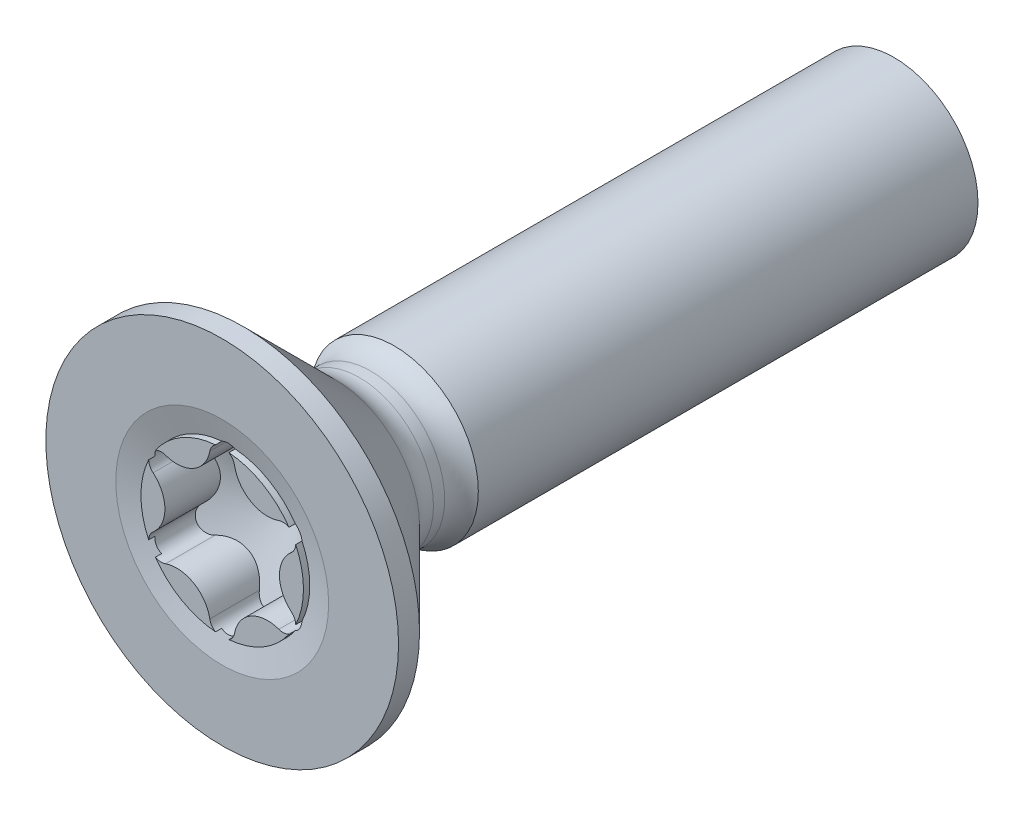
ISO-10303-21;
HEADER;
FILE_DESCRIPTION(('STEP AP214'),'2;1');
FILE_NAME('part.step','',(''),(''),'','','');
FILE_SCHEMA(('AUTOMOTIVE_DESIGN { 1 0 10303 214 1 1 1 1 }'));
ENDSEC;
DATA;
#1=APPLICATION_CONTEXT('core data for automotive mechanical design processes');
#2=APPLICATION_PROTOCOL_DEFINITION('international standard','automotive_design',2000,#1);
#3=PRODUCT_CONTEXT('',#1,'mechanical');
#4=PRODUCT('Part','Part','',(#3));
#5=PRODUCT_RELATED_PRODUCT_CATEGORY('part','',(#4));
#6=PRODUCT_DEFINITION_FORMATION('','',#4);
#7=PRODUCT_DEFINITION_CONTEXT('part definition',#1,'design');
#8=PRODUCT_DEFINITION('design','',#6,#7);
#9=PRODUCT_DEFINITION_SHAPE('','',#8);
#10=(LENGTH_UNIT() NAMED_UNIT(*) SI_UNIT(.MILLI.,.METRE.));
#11=(NAMED_UNIT(*) PLANE_ANGLE_UNIT() SI_UNIT($,.RADIAN.));
#12=(NAMED_UNIT(*) SI_UNIT($,.STERADIAN.) SOLID_ANGLE_UNIT());
#13=UNCERTAINTY_MEASURE_WITH_UNIT(LENGTH_MEASURE(1.E-05),#10,'distance_accuracy_value','');
#14=(GEOMETRIC_REPRESENTATION_CONTEXT(3) GLOBAL_UNCERTAINTY_ASSIGNED_CONTEXT((#13)) GLOBAL_UNIT_ASSIGNED_CONTEXT((#10,
#11,#12)) REPRESENTATION_CONTEXT('',''));
#15=CARTESIAN_POINT('',(0.,0.,0.));
#16=DIRECTION('',(0.,0.,1.));
#17=DIRECTION('',(1.,0.,0.));
#18=AXIS2_PLACEMENT_3D('',#15,#16,#17);
#19=CARTESIAN_POINT('',(0.,4.2,0.));
#20=DIRECTION('',(0.,0.,-1.));
#21=DIRECTION('',(-1.,0.,0.));
#22=AXIS2_PLACEMENT_3D('',#19,#20,#21);
#23=PLANE('',#22);
#24=CARTESIAN_POINT('',(0.,0.,0.));
#25=DIRECTION('',(0.,0.,1.));
#26=DIRECTION('',(1.,0.,0.));
#27=AXIS2_PLACEMENT_3D('',#24,#25,#26);
#28=CIRCLE('',#27,2.53480762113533);
#29=CARTESIAN_POINT('',(2.53480762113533,0.,0.));
#30=VERTEX_POINT('',#29);
#31=EDGE_CURVE('E472',#30,#30,#28,.T.);
#32=ORIENTED_EDGE('',*,*,#31,.F.);
#33=EDGE_LOOP('',(#32));
#34=FACE_BOUND('',#33,.T.);
#35=CARTESIAN_POINT('',(0.,0.,0.));
#36=DIRECTION('',(0.,0.,1.));
#37=DIRECTION('',(1.,0.,0.));
#38=AXIS2_PLACEMENT_3D('',#35,#36,#37);
#39=CIRCLE('',#38,4.2);
#40=CARTESIAN_POINT('',(4.2,0.,0.));
#41=VERTEX_POINT('',#40);
#42=EDGE_CURVE('E669',#41,#41,#39,.T.);
#43=ORIENTED_EDGE('',*,*,#42,.T.);
#44=EDGE_LOOP('',(#43));
#45=FACE_BOUND('',#44,.T.);
#46=ADVANCED_FACE('F14',(#34,#45),#23,.F.);
#47=CARTESIAN_POINT('',(0.,0.,-16.));
#48=DIRECTION('',(0.,0.,1.));
#49=DIRECTION('',(1.,0.,0.));
#50=AXIS2_PLACEMENT_3D('',#47,#48,#49);
#51=PLANE('',#50);
#52=CARTESIAN_POINT('',(0.,0.,-16.));
#53=DIRECTION('',(0.,0.,1.));
#54=DIRECTION('',(1.,0.,0.));
#55=AXIS2_PLACEMENT_3D('',#52,#53,#54);
#56=CIRCLE('',#55,2.);
#57=CARTESIAN_POINT('',(2.,0.,-16.));
#58=VERTEX_POINT('',#57);
#59=EDGE_CURVE('E9',#58,#58,#56,.T.);
#60=ORIENTED_EDGE('',*,*,#59,.F.);
#61=EDGE_LOOP('',(#60));
#62=FACE_BOUND('',#61,.T.);
#63=ADVANCED_FACE('F355',(#62),#51,.F.);
#64=CARTESIAN_POINT('',(0.,0.,0.));
#65=DIRECTION('',(0.,0.,1.));
#66=DIRECTION('',(1.,0.,0.));
#67=AXIS2_PLACEMENT_3D('',#64,#65,#66);
#68=CYLINDRICAL_SURFACE('',#67,2.);
#69=CARTESIAN_POINT('',(0.,0.,-4.1));
#70=DIRECTION('',(0.,0.,1.));
#71=DIRECTION('',(1.,0.,0.));
#72=AXIS2_PLACEMENT_3D('',#69,#70,#71);
#73=CIRCLE('',#72,2.);
#74=CARTESIAN_POINT('',(2.,0.,-4.1));
#75=VERTEX_POINT('',#74);
#76=EDGE_CURVE('E23',#75,#75,#73,.T.);
#77=ORIENTED_EDGE('',*,*,#76,.F.);
#78=EDGE_LOOP('',(#77));
#79=FACE_BOUND('',#78,.T.);
#80=ORIENTED_EDGE('',*,*,#59,.T.);
#81=EDGE_LOOP('',(#80));
#82=FACE_BOUND('',#81,.T.);
#83=ADVANCED_FACE('F361',(#79,#82),#68,.T.);
#84=CARTESIAN_POINT('',(0.,0.,-3.53431457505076));
#85=DIRECTION('',(0.,0.,1.));
#86=DIRECTION('',(1.,0.,0.));
#87=AXIS2_PLACEMENT_3D('',#84,#85,#86);
#88=TOROIDAL_SURFACE('',#87,2.56568542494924,0.8);
#89=ORIENTED_EDGE('',*,*,#76,.T.);
#90=EDGE_LOOP('',(#89));
#91=FACE_BOUND('',#90,.T.);
#92=CARTESIAN_POINT('',(0.,0.,-3.53431457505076));
#93=DIRECTION('',(0.,0.,1.));
#94=DIRECTION('',(1.,0.,0.));
#95=AXIS2_PLACEMENT_3D('',#92,#93,#94);
#96=CIRCLE('',#95,1.76568542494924);
#97=CARTESIAN_POINT('',(1.76568542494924,0.,-3.53431457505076));
#98=VERTEX_POINT('',#97);
#99=EDGE_CURVE('E917',#98,#98,#96,.T.);
#100=ORIENTED_EDGE('',*,*,#99,.F.);
#101=EDGE_LOOP('',(#100));
#102=FACE_BOUND('',#101,.T.);
#103=ADVANCED_FACE('F922',(#91,#102),#88,.F.);
#104=CARTESIAN_POINT('',(0.,0.,0.));
#105=DIRECTION('',(0.,0.,1.));
#106=DIRECTION('',(1.,0.,0.));
#107=AXIS2_PLACEMENT_3D('',#104,#105,#106);
#108=CYLINDRICAL_SURFACE('',#107,1.76568542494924);
#109=CARTESIAN_POINT('',(0.,0.,-3.26568542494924));
#110=DIRECTION('',(0.,0.,1.));
#111=DIRECTION('',(1.,0.,0.));
#112=AXIS2_PLACEMENT_3D('',#109,#110,#111);
#113=CIRCLE('',#112,1.76568542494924);
#114=CARTESIAN_POINT('',(1.76568542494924,0.,-3.26568542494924));
#115=VERTEX_POINT('',#114);
#116=EDGE_CURVE('E903',#115,#115,#113,.T.);
#117=ORIENTED_EDGE('',*,*,#116,.F.);
#118=EDGE_LOOP('',(#117));
#119=FACE_BOUND('',#118,.T.);
#120=ORIENTED_EDGE('',*,*,#99,.T.);
#121=EDGE_LOOP('',(#120));
#122=FACE_BOUND('',#121,.T.);
#123=ADVANCED_FACE('F908',(#119,#122),#108,.T.);
#124=CARTESIAN_POINT('',(0.,0.,-3.26568542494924));
#125=DIRECTION('',(0.,0.,1.));
#126=DIRECTION('',(1.,0.,0.));
#127=AXIS2_PLACEMENT_3D('',#124,#125,#126);
#128=TOROIDAL_SURFACE('',#127,2.56568542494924,0.8);
#129=ORIENTED_EDGE('',*,*,#116,.T.);
#130=EDGE_LOOP('',(#129));
#131=FACE_BOUND('',#130,.T.);
#132=CARTESIAN_POINT('',(0.,0.,-2.7));
#133=DIRECTION('',(0.,0.,1.));
#134=DIRECTION('',(1.,0.,0.));
#135=AXIS2_PLACEMENT_3D('',#132,#133,#134);
#136=CIRCLE('',#135,2.);
#137=CARTESIAN_POINT('',(2.,0.,-2.7));
#138=VERTEX_POINT('',#137);
#139=EDGE_CURVE('E889',#138,#138,#136,.T.);
#140=ORIENTED_EDGE('',*,*,#139,.F.);
#141=EDGE_LOOP('',(#140));
#142=FACE_BOUND('',#141,.T.);
#143=ADVANCED_FACE('F894',(#131,#142),#128,.F.);
#144=CARTESIAN_POINT('',(0.,0.,-2.7));
#145=DIRECTION('',(0.,0.,1.));
#146=DIRECTION('',(1.,0.,0.));
#147=AXIS2_PLACEMENT_3D('',#144,#145,#146);
#148=CONICAL_SURFACE('',#147,2.,0.785398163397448);
#149=CARTESIAN_POINT('',(0.,0.,-0.5));
#150=DIRECTION('',(0.,0.,1.));
#151=DIRECTION('',(1.,0.,0.));
#152=AXIS2_PLACEMENT_3D('',#149,#150,#151);
#153=CIRCLE('',#152,4.2);
#154=CARTESIAN_POINT('',(4.2,0.,-0.5));
#155=VERTEX_POINT('',#154);
#156=EDGE_CURVE('E675',#155,#155,#153,.T.);
#157=ORIENTED_EDGE('',*,*,#156,.F.);
#158=EDGE_LOOP('',(#157));
#159=FACE_BOUND('',#158,.T.);
#160=ORIENTED_EDGE('',*,*,#139,.T.);
#161=EDGE_LOOP('',(#160));
#162=FACE_BOUND('',#161,.T.);
#163=ADVANCED_FACE('F881',(#159,#162),#148,.T.);
#164=CARTESIAN_POINT('',(0.,0.,0.));
#165=DIRECTION('',(0.,0.,1.));
#166=DIRECTION('',(1.,0.,0.));
#167=AXIS2_PLACEMENT_3D('',#164,#165,#166);
#168=CYLINDRICAL_SURFACE('',#167,4.2);
#169=ORIENTED_EDGE('',*,*,#42,.F.);
#170=EDGE_LOOP('',(#169));
#171=FACE_BOUND('',#170,.T.);
#172=ORIENTED_EDGE('',*,*,#156,.T.);
#173=EDGE_LOOP('',(#172));
#174=FACE_BOUND('',#173,.T.);
#175=ADVANCED_FACE('F352',(#171,#174),#168,.T.);
#176=CARTESIAN_POINT('',(0.,0.,-1.1));
#177=DIRECTION('',(0.,0.,1.));
#178=DIRECTION('',(1.,0.,0.));
#179=AXIS2_PLACEMENT_3D('',#176,#177,#178);
#180=CONICAL_SURFACE('',#179,1.975,1.22173047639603);
#181=CARTESIAN_POINT('',(0.,0.,-1.81884121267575));
#182=VERTEX_POINT('',#181);
#183=VERTEX_LOOP('',#182);
#184=FACE_BOUND('',#183,.T.);
#185=CARTESIAN_POINT('',(-1.3500312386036,1.12014363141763,-1.18035545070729));
#186=CARTESIAN_POINT('',(-1.36618318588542,1.12590441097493,-1.17449124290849));
#187=CARTESIAN_POINT('',(-1.38289591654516,1.13027607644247,-1.16878422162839));
#188=CARTESIAN_POINT('',(-1.41698574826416,1.1361100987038,-1.15780468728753));
#189=CARTESIAN_POINT('',(-1.43436377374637,1.13756824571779,-1.15253281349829));
#190=CARTESIAN_POINT('',(-1.46930553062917,1.13742661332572,-1.14255339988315));
#191=CARTESIAN_POINT('',(-1.48686951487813,1.13582193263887,-1.13784677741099));
#192=CARTESIAN_POINT('',(-1.52159625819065,1.12950921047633,-1.12913169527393));
#193=CARTESIAN_POINT('',(-1.53875937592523,1.12480406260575,-1.12512258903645));
#194=CARTESIAN_POINT('',(-1.57149496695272,1.1125930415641,-1.11804420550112));
#195=CARTESIAN_POINT('',(-1.58710308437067,1.10520020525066,-1.11494504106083));
#196=CARTESIAN_POINT('',(-1.61692434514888,1.08776362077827,-1.10957252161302));
#197=CARTESIAN_POINT('',(-1.63113749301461,1.07771988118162,-1.10729916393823));
#198=CARTESIAN_POINT('',(-1.65706383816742,1.05577665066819,-1.10372789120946));
#199=CARTESIAN_POINT('',(-1.66886209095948,1.04398408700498,-1.10238983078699));
#200=CARTESIAN_POINT('',(-1.69036493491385,1.0185692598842,-1.10056031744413));
#201=CARTESIAN_POINT('',(-1.70007011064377,1.00494750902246,-1.10006862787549));
#202=CARTESIAN_POINT('',(-1.71684750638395,0.976679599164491,-1.09994649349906));
#203=CARTESIAN_POINT('',(-1.72398549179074,0.962072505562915,-1.10029245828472));
#204=CARTESIAN_POINT('',(-1.73580137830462,0.9319344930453,-1.10178746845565));
#205=CARTESIAN_POINT('',(-1.74047933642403,0.916403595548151,-1.10293649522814));
#206=CARTESIAN_POINT('',(-1.74726118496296,0.884900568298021,-1.10600486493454));
#207=CARTESIAN_POINT('',(-1.74937058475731,0.868929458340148,-1.10792254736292));
#208=CARTESIAN_POINT('',(-1.75101884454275,0.836960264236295,-1.1124808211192));
#209=CARTESIAN_POINT('',(-1.75055764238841,0.820962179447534,-1.11512142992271));
#210=CARTESIAN_POINT('',(-1.74709253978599,0.789002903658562,-1.12113170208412));
#211=CARTESIAN_POINT('',(-1.74403086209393,0.773050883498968,-1.12451662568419));
#212=CARTESIAN_POINT('',(-1.73543431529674,0.741973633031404,-1.13190105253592));
#213=CARTESIAN_POINT('',(-1.72989833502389,0.726848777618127,-1.13590083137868));
#214=CARTESIAN_POINT('',(-1.71627998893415,0.697187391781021,-1.14460575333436));
#215=CARTESIAN_POINT('',(-1.70810063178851,0.682702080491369,-1.1493334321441));
#216=CARTESIAN_POINT('',(-1.68957046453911,0.655397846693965,-1.15925048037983));
#217=CARTESIAN_POINT('',(-1.6792219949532,0.642577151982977,-1.16443934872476));
#218=CARTESIAN_POINT('',(-1.6606968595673,0.623099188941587,-1.1732533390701));
#219=CARTESIAN_POINT('',(-1.65306163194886,0.61587434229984,-1.17677627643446));
#220=CARTESIAN_POINT('',(-1.64508772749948,0.609088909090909,-1.18035577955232));
#221=B_SPLINE_CURVE_WITH_KNOTS('',3,(#185,#186,#187,#188,#189,#190,#191,#192,#193,#194,#195,
#196,#197,#198,#199,#200,#201,#202,#203,#204,#205,#206,#207,#208,#209,#210,#211,#212,#213,#214,
#215,#216,#217,#218,#219,#220),.UNSPECIFIED.,.F.,.F.,(4,2,2,2,2,2,2,2,2,2,2,2,2,2,2,2,2,4),(0.,
0.0543223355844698,0.108723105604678,0.163211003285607,0.217648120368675,0.270019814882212,
0.322391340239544,0.372347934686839,0.422290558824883,0.470843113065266,0.5193945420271,
0.567841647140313,0.616289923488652,0.665843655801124,0.715419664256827,0.767073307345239,
0.81867149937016,0.851870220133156),.UNSPECIFIED.);
#222=CARTESIAN_POINT('',(-1.3500332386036,1.12014434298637,-1.18035472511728));
#223=VERTEX_POINT('',#222);
#224=CARTESIAN_POINT('',(-1.64509007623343,0.609090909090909,-1.18035472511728));
#225=VERTEX_POINT('',#224);
#226=EDGE_CURVE('E612',#223,#225,#221,.T.);
#227=ORIENTED_EDGE('',*,*,#226,.T.);
#228=CARTESIAN_POINT('',(-1.64509207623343,-0.60909261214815,-1.18035382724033));
#229=CARTESIAN_POINT('',(-1.61159609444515,-0.580595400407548,-1.19536072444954));
#230=CARTESIAN_POINT('',(-1.5803275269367,-0.549179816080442,-1.20995889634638));
#231=CARTESIAN_POINT('',(-1.52296757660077,-0.481024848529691,-1.23760423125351));
#232=CARTESIAN_POINT('',(-1.49690547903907,-0.444257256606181,-1.25064246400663));
#233=CARTESIAN_POINT('',(-1.45100015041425,-0.366124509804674,-1.27428667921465));
#234=CARTESIAN_POINT('',(-1.431175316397,-0.324746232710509,-1.28488544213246));
#235=CARTESIAN_POINT('',(-1.398788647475,-0.238623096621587,-1.30256271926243));
#236=CARTESIAN_POINT('',(-1.38620798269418,-0.193887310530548,-1.30965035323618));
#237=CARTESIAN_POINT('',(-1.36970666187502,-0.106336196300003,-1.31902779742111));
#238=CARTESIAN_POINT('',(-1.365140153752,-0.0636814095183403,-1.32167457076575));
#239=CARTESIAN_POINT('',(-1.36290633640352,0.0218776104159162,-1.32296356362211));
#240=CARTESIAN_POINT('',(-1.3652386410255,0.0647818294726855,-1.32160600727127));
#241=CARTESIAN_POINT('',(-1.37617534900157,0.145794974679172,-1.31534471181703));
#242=CARTESIAN_POINT('',(-1.38423601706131,0.184003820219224,-1.31074867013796));
#243=CARTESIAN_POINT('',(-1.40565806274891,0.258452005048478,-1.29880474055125));
#244=CARTESIAN_POINT('',(-1.41902111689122,0.294690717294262,-1.29145598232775));
#245=CARTESIAN_POINT('',(-1.45137512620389,0.366256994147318,-1.27414882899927));
#246=CARTESIAN_POINT('',(-1.47062184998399,0.401440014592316,-1.26407492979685));
#247=CARTESIAN_POINT('',(-1.51382715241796,0.468165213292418,-1.24218396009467));
#248=CARTESIAN_POINT('',(-1.53778437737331,0.499708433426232,-1.2303673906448));
#249=CARTESIAN_POINT('',(-1.57641967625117,0.543515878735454,-1.21193576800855));
#250=CARTESIAN_POINT('',(-1.58955072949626,0.557366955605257,-1.20576318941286));
#251=CARTESIAN_POINT('',(-1.61668091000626,0.584016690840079,-1.19320719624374));
#252=CARTESIAN_POINT('',(-1.63067795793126,0.596817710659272,-1.18682430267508));
#253=CARTESIAN_POINT('',(-1.64509207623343,0.60909261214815,-1.18035382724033));
#254=B_SPLINE_CURVE_WITH_KNOTS('',3,(#228,#229,#230,#231,#232,#233,#234,#235,#236,#237,#238,
#239,#240,#241,#242,#243,#244,#245,#246,#247,#248,#249,#250,#251,#252,#253),.UNSPECIFIED.,.F.,
.F.,(4,2,2,2,2,2,2,2,2,2,2,2,4),(0.,0.139343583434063,0.279450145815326,0.419966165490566,
0.560115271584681,0.688337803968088,0.816553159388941,0.933990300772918,1.05146460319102,
1.17502683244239,1.2985536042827,1.35869155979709,1.4186903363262),.UNSPECIFIED.);
#255=CARTESIAN_POINT('',(-1.64509007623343,-0.609090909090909,-1.18035472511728));
#256=VERTEX_POINT('',#255);
#257=EDGE_CURVE('E670',#256,#225,#254,.T.);
#258=ORIENTED_EDGE('',*,*,#257,.F.);
#259=CARTESIAN_POINT('',(-1.64508772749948,-0.60908890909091,-1.18035577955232));
#260=CARTESIAN_POINT('',(-1.65815272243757,-0.620196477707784,-1.17449156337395));
#261=CARTESIAN_POINT('',(-1.6702951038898,-0.632484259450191,-1.16878453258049));
#262=CARTESIAN_POINT('',(-1.69239252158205,-0.659089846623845,-1.15780497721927));
#263=CARTESIAN_POINT('',(-1.70234437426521,-0.673410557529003,-1.15253309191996));
#264=CARTESIAN_POINT('',(-1.71969269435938,-0.703741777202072,-1.14255365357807));
#265=CARTESIAN_POINT('',(-1.72708504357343,-0.719754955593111,-1.13784701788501));
#266=CARTESIAN_POINT('',(-1.73898154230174,-0.752985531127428,-1.12913190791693));
#267=CARTESIAN_POINT('',(-1.74348837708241,-0.770201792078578,-1.12512278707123));
#268=CARTESIAN_POINT('',(-1.74928122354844,-0.804657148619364,-1.11804437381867));
#269=CARTESIAN_POINT('',(-1.75068295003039,-0.821870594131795,-1.11494519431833));
#270=CARTESIAN_POINT('',(-1.75049315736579,-0.856414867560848,-1.10957264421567));
#271=CARTESIAN_POINT('',(-1.74890164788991,-0.873745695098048,-1.10729927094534));
#272=CARTESIAN_POINT('',(-1.74286152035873,-0.907170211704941,-1.10372796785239));
#273=CARTESIAN_POINT('',(-1.73854803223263,-0.923284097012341,-1.10238989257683));
#274=CARTESIAN_POINT('',(-1.72728965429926,-0.954613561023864,-1.10056034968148));
#275=CARTESIAN_POINT('',(-1.72034550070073,-0.969829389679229,-1.10006864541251));
#276=CARTESIAN_POINT('',(-1.70425354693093,-0.998493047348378,-1.09994648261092));
#277=CARTESIAN_POINT('',(-1.69517246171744,-1.01197829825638,-1.10029243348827));
#278=CARTESIAN_POINT('',(-1.67498018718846,-1.03728022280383,-1.10178741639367));
#279=CARTESIAN_POINT('',(-1.66386904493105,-1.04909693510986,-1.10293642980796));
#280=CARTESIAN_POINT('',(-1.63997760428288,-1.07072176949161,-1.10600477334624));
#281=CARTESIAN_POINT('',(-1.62720094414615,-1.08053415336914,-1.10792244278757));
#282=CARTESIAN_POINT('',(-1.60033898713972,-1.09794625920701,-1.11248069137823));
#283=CARTESIAN_POINT('',(-1.58625365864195,-1.10554592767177,-1.11512128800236));
#284=CARTESIAN_POINT('',(-1.55684359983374,-1.11852477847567,-1.12113153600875));
#285=CARTESIAN_POINT('',(-1.54149792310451,-1.12384933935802,-1.1245164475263));
#286=CARTESIAN_POINT('',(-1.51028598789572,-1.13194322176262,-1.13190085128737));
#287=CARTESIAN_POINT('',(-1.49441949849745,-1.13471139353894,-1.13590061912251));
#288=CARTESIAN_POINT('',(-1.46192282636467,-1.13774834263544,-1.14460551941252));
#289=CARTESIAN_POINT('',(-1.44528850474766,-1.13790751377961,-1.14933318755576));
#290=CARTESIAN_POINT('',(-1.41237726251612,-1.13551212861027,-1.15925021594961));
#291=CARTESIAN_POINT('',(-1.39609997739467,-1.13296048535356,-1.1644390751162));
#292=CARTESIAN_POINT('',(-1.36996901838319,-1.12665631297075,-1.17325304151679));
#293=CARTESIAN_POINT('',(-1.35989452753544,-1.1236564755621,-1.17677596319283));
#294=CARTESIAN_POINT('',(-1.3500312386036,-1.12014363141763,-1.18035545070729));
#295=B_SPLINE_CURVE_WITH_KNOTS('',3,(#259,#260,#261,#262,#263,#264,#265,#266,#267,#268,#269,
#270,#271,#272,#273,#274,#275,#276,#277,#278,#279,#280,#281,#282,#283,#284,#285,#286,#287,#288,
#289,#290,#291,#292,#293,#294),.UNSPECIFIED.,.F.,.F.,(4,2,2,2,2,2,2,2,2,2,2,2,2,2,2,2,2,4),(0.,
0.0543223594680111,0.108723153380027,0.163211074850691,0.217648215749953,0.270019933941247,
0.322391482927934,0.372348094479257,0.42229073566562,0.470843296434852,0.519394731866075,
0.567841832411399,0.616290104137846,0.66584382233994,0.715419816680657,0.767073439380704,
0.818671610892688,0.851870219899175),.UNSPECIFIED.);
#296=CARTESIAN_POINT('',(-1.3500332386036,-1.12014434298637,-1.18035472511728));
#297=VERTEX_POINT('',#296);
#298=EDGE_CURVE('E323',#256,#297,#295,.T.);
#299=ORIENTED_EDGE('',*,*,#298,.T.);
#300=CARTESIAN_POINT('',(-0.295056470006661,-1.72923725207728,-1.18035403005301));
#301=CARTESIAN_POINT('',(-0.302987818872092,-1.68598028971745,-1.19536091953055));
#302=CARTESIAN_POINT('',(-0.314560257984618,-1.64319314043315,-1.20995908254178));
#303=CARTESIAN_POINT('',(-0.344904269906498,-1.55944051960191,-1.23760439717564));
#304=CARTESIAN_POINT('',(-0.363714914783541,-1.51848630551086,-1.25064261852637));
#305=CARTESIAN_POINT('',(-0.408427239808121,-1.43966479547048,-1.27428680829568));
#306=CARTESIAN_POINT('',(-0.434349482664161,-1.40180687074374,-1.2848855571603));
#307=CARTESIAN_POINT('',(-0.492741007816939,-1.33069767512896,-1.3025628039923));
#308=CARTESIAN_POINT('',(-0.525193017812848,-1.29743463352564,-1.30965042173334));
#309=CARTESIAN_POINT('',(-0.592763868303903,-1.23936856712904,-1.31902783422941));
#310=CARTESIAN_POINT('',(-0.627420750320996,-1.21408648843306,-1.32167459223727));
#311=CARTESIAN_POINT('',(-0.700400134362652,-1.16937248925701,-1.32296355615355));
#312=CARTESIAN_POINT('',(-0.738722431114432,-1.14994024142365,-1.32160598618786));
#313=CARTESIAN_POINT('',(-0.814350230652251,-1.11890518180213,-1.31534466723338));
#314=CARTESIAN_POINT('',(-0.851470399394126,-1.10678152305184,-1.31074861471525));
#315=CARTESIAN_POINT('',(-0.926655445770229,-1.08810950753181,-1.29880466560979));
#316=CARTESIAN_POINT('',(-0.964720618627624,-1.08156291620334,-1.29145589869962));
#317=CARTESIAN_POINT('',(-1.04287584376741,-1.07379921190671,-1.274148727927));
#318=CARTESIAN_POINT('',(-1.08296860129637,-1.07287587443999,-1.26407481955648));
#319=CARTESIAN_POINT('',(-1.16235697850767,-1.07693020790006,-1.2421838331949));
#320=CARTESIAN_POINT('',(-1.201652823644,-1.08190618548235,-1.23036725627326));
#321=CARTESIAN_POINT('',(-1.25890867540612,-1.0934616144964,-1.2119356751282));
#322=CARTESIAN_POINT('',(-1.27746943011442,-1.09790786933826,-1.20576314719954));
#323=CARTESIAN_POINT('',(-1.31411356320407,-1.10807834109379,-1.19320725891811));
#324=CARTESIAN_POINT('',(-1.33219794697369,-1.11379957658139,-1.18682441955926));
#325=CARTESIAN_POINT('',(-1.3500352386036,-1.12014505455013,-1.18035399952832));
#326=B_SPLINE_CURVE_WITH_KNOTS('',3,(#300,#301,#302,#303,#304,#305,#306,#307,#308,#309,#310,
#311,#312,#313,#314,#315,#316,#317,#318,#319,#320,#321,#322,#323,#324,#325),.UNSPECIFIED.,.F.,
.F.,(4,2,2,2,2,2,2,2,2,2,2,2,4),(0.,0.139343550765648,0.279450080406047,0.419966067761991,
0.560115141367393,0.688337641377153,0.816552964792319,0.933990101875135,1.05146440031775,
1.17502665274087,1.29855344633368,1.35869090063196,1.4186891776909),.UNSPECIFIED.);
#327=CARTESIAN_POINT('',(-0.295056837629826,-1.72923525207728,-1.18035472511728));
#328=VERTEX_POINT('',#327);
#329=EDGE_CURVE('E699',#328,#297,#326,.T.);
#330=ORIENTED_EDGE('',*,*,#329,.F.);
#331=CARTESIAN_POINT('',(-0.295057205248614,-1.72923325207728,-1.18035542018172));
#332=CARTESIAN_POINT('',(-0.291970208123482,-1.74610163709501,-1.17449121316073));
#333=CARTESIAN_POINT('',(-0.287399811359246,-1.7627611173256,-1.1687841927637));
#334=CARTESIAN_POINT('',(-0.275407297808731,-1.79520078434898,-1.15780466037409));
#335=CARTESIAN_POINT('',(-0.267981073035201,-1.81097966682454,-1.15253278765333));
#336=CARTESIAN_POINT('',(-0.250387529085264,-1.84116929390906,-1.14255337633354));
#337=CARTESIAN_POINT('',(-0.240215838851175,-1.85557780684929,-1.13784675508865));
#338=CARTESIAN_POINT('',(-0.217385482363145,-1.88249568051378,-1.12913167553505));
#339=CARTESIAN_POINT('',(-0.204729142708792,-1.89500679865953,-1.12512257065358));
#340=CARTESIAN_POINT('',(-0.177786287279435,-1.91725113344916,-1.1180441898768));
#341=CARTESIAN_POINT('',(-0.163579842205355,-1.92707173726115,-1.11494502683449));
#342=CARTESIAN_POINT('',(-0.133568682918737,-1.94417940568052,-1.10957251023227));
#343=CARTESIAN_POINT('',(-0.117763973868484,-1.95146647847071,-1.10729915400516));
#344=CARTESIAN_POINT('',(-0.085797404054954,-1.96294772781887,-1.10372788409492));
#345=CARTESIAN_POINT('',(-0.0696856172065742,-1.96726902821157,-1.10238982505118));
#346=CARTESIAN_POINT('',(-0.0369243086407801,-1.97318361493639,-1.10056031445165));
#347=CARTESIAN_POINT('',(-0.0202749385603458,-1.97477766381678,-1.10006862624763));
#348=CARTESIAN_POINT('',(0.0125944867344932,-1.97517335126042,-1.09994649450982));
#349=CARTESIAN_POINT('',(0.0288135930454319,-1.97405147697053,-1.10029246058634));
#350=CARTESIAN_POINT('',(0.0608218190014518,-1.96921532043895,-1.10178747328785));
#351=CARTESIAN_POINT('',(0.0766109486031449,-1.96550109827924,-1.10293650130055));
#352=CARTESIAN_POINT('',(0.107284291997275,-1.95562283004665,-1.10600487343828));
#353=CARTESIAN_POINT('',(0.122170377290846,-1.94946406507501,-1.10792255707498));
#354=CARTESIAN_POINT('',(0.150680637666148,-1.93490689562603,-1.11248083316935));
#355=CARTESIAN_POINT('',(0.164304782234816,-1.9265084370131,-1.11512144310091));
#356=CARTESIAN_POINT('',(0.1902497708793,-1.90752792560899,-1.12113171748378));
#357=CARTESIAN_POINT('',(0.202533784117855,-1.89690042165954,-1.12451664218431));
#358=CARTESIAN_POINT('',(0.225149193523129,-1.87391696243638,-1.13190107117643));
#359=CARTESIAN_POINT('',(0.235479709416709,-1.86156023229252,-1.13590085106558));
#360=CARTESIAN_POINT('',(0.254358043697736,-1.8349357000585,-1.14460577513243));
#361=CARTESIAN_POINT('',(0.262813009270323,-1.82060951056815,-1.14933345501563));
#362=CARTESIAN_POINT('',(0.277194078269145,-1.79090979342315,-1.15925050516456));
#363=CARTESIAN_POINT('',(0.28312288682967,-1.77553740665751,-1.16443937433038));
#364=CARTESIAN_POINT('',(0.290728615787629,-1.74975554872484,-1.17325324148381));
#365=CARTESIAN_POINT('',(0.293167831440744,-1.73953119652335,-1.17677604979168));
#366=CARTESIAN_POINT('',(0.295057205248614,-1.72923325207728,-1.18035542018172));
#367=B_SPLINE_CURVE_WITH_KNOTS('',3,(#331,#332,#333,#334,#335,#336,#337,#338,#339,#340,#341,
#342,#343,#344,#345,#346,#347,#348,#349,#350,#351,#352,#353,#354,#355,#356,#357,#358,#359,#360,
#361,#362,#363,#364,#365,#366),.UNSPECIFIED.,.F.,.F.,(4,2,2,2,2,2,2,2,2,2,2,2,2,2,2,2,2,4),(0.,
0.0543223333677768,0.108723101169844,0.163210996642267,0.217648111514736,0.270019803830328,
0.322391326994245,0.372347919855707,0.422290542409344,0.47084309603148,0.519394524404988,
0.567841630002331,0.616289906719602,0.665843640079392,0.715419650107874,0.767073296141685,
0.81867148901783,0.85186901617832),.UNSPECIFIED.);
#368=CARTESIAN_POINT('',(0.295056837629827,-1.72923525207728,-1.18035472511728));
#369=VERTEX_POINT('',#368);
#370=EDGE_CURVE('E336',#328,#369,#367,.T.);
#371=ORIENTED_EDGE('',*,*,#370,.T.);
#372=CARTESIAN_POINT('',(1.3500352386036,-1.12014505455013,-1.18035399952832));
#373=CARTESIAN_POINT('',(1.30860793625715,-1.10538531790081,-1.19536089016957));
#374=CARTESIAN_POINT('',(1.26576695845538,-1.09401376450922,-1.20995905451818));
#375=CARTESIAN_POINT('',(1.1780630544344,-1.07841612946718,-1.2376043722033));
#376=CARTESIAN_POINT('',(1.1331903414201,-1.07422951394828,-1.25064259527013));
#377=CARTESIAN_POINT('',(1.0425727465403,-1.07354075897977,-1.27428678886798));
#378=CARTESIAN_POINT('',(0.996825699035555,-1.07706111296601,-1.28488553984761));
#379=CARTESIAN_POINT('',(0.906047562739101,-1.09207505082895,-1.30256279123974));
#380=CARTESIAN_POINT('',(0.86101491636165,-1.10354779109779,-1.30965041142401));
#381=CARTESIAN_POINT('',(0.776942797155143,-1.13303282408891,-1.31902782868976));
#382=CARTESIAN_POINT('',(0.737719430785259,-1.15040552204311,-1.32167458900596));
#383=CARTESIAN_POINT('',(0.662506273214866,-1.19125051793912,-1.32296355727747));
#384=CARTESIAN_POINT('',(0.626516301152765,-1.21472247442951,-1.32160598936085));
#385=CARTESIAN_POINT('',(0.561825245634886,-1.26470053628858,-1.31534467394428));
#386=CARTESIAN_POINT('',(0.532765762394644,-1.29078571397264,-1.31074862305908));
#387=CARTESIAN_POINT('',(0.479002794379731,-1.34656186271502,-1.2988046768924));
#388=CARTESIAN_POINT('',(0.454300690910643,-1.37625397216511,-1.29145591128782));
#389=CARTESIAN_POINT('',(0.408499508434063,-1.44005652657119,-1.27414874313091));
#390=CARTESIAN_POINT('',(0.387653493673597,-1.47431620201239,-1.26407483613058));
#391=CARTESIAN_POINT('',(0.351470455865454,-1.54509571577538,-1.24218385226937));
#392=CARTESIAN_POINT('',(0.336131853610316,-1.58161490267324,-1.23036727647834));
#393=CARTESIAN_POINT('',(0.317511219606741,-1.63697763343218,-1.21193569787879));
#394=CARTESIAN_POINT('',(0.312081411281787,-1.65527484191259,-1.205763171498));
#395=CARTESIAN_POINT('',(0.30256722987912,-1.69209481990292,-1.193207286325));
#396=CARTESIAN_POINT('',(0.298479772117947,-1.71061696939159,-1.18682444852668));
#397=CARTESIAN_POINT('',(0.295056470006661,-1.72923725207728,-1.18035403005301));
#398=B_SPLINE_CURVE_WITH_KNOTS('',3,(#372,#373,#374,#375,#376,#377,#378,#379,#380,#381,#382,
#383,#384,#385,#386,#387,#388,#389,#390,#391,#392,#393,#394,#395,#396,#397),.UNSPECIFIED.,.F.,
.F.,(4,2,2,2,2,2,2,2,2,2,2,2,4),(0.,0.139343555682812,0.279450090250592,0.419966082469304,
0.560115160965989,0.688337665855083,0.816552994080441,0.933990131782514,1.05146443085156,
1.17502667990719,1.29855347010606,1.35869091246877,1.41868917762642),.UNSPECIFIED.);
#399=CARTESIAN_POINT('',(1.3500332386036,-1.12014434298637,-1.18035472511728));
#400=VERTEX_POINT('',#399);
#401=EDGE_CURVE('E500',#400,#369,#398,.T.);
#402=ORIENTED_EDGE('',*,*,#401,.F.);
#403=CARTESIAN_POINT('',(1.3500312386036,-1.12014363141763,-1.18035545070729));
#404=CARTESIAN_POINT('',(1.36618318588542,-1.12590441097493,-1.17449124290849));
#405=CARTESIAN_POINT('',(1.38289591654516,-1.13027607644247,-1.16878422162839));
#406=CARTESIAN_POINT('',(1.41698574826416,-1.1361100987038,-1.15780468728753));
#407=CARTESIAN_POINT('',(1.43436377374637,-1.13756824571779,-1.15253281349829));
#408=CARTESIAN_POINT('',(1.46930553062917,-1.13742661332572,-1.14255339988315));
#409=CARTESIAN_POINT('',(1.48686951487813,-1.13582193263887,-1.13784677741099));
#410=CARTESIAN_POINT('',(1.52159625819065,-1.12950921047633,-1.12913169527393));
#411=CARTESIAN_POINT('',(1.53875937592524,-1.12480406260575,-1.12512258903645));
#412=CARTESIAN_POINT('',(1.57149496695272,-1.1125930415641,-1.11804420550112));
#413=CARTESIAN_POINT('',(1.58710308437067,-1.10520020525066,-1.11494504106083));
#414=CARTESIAN_POINT('',(1.61692434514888,-1.08776362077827,-1.10957252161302));
#415=CARTESIAN_POINT('',(1.63113749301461,-1.07771988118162,-1.10729916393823));
#416=CARTESIAN_POINT('',(1.65706383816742,-1.05577665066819,-1.10372789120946));
#417=CARTESIAN_POINT('',(1.66886209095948,-1.04398408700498,-1.10238983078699));
#418=CARTESIAN_POINT('',(1.69036493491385,-1.0185692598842,-1.10056031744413));
#419=CARTESIAN_POINT('',(1.70007011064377,-1.00494750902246,-1.10006862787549));
#420=CARTESIAN_POINT('',(1.71684750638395,-0.976679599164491,-1.09994649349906));
#421=CARTESIAN_POINT('',(1.72398549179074,-0.962072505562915,-1.10029245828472));
#422=CARTESIAN_POINT('',(1.73580137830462,-0.9319344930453,-1.10178746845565));
#423=CARTESIAN_POINT('',(1.74047933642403,-0.916403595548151,-1.10293649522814));
#424=CARTESIAN_POINT('',(1.74726118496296,-0.884900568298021,-1.10600486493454));
#425=CARTESIAN_POINT('',(1.74937058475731,-0.868929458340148,-1.10792254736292));
#426=CARTESIAN_POINT('',(1.75101884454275,-0.836960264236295,-1.1124808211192));
#427=CARTESIAN_POINT('',(1.75055764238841,-0.820962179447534,-1.11512142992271));
#428=CARTESIAN_POINT('',(1.74709253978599,-0.789002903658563,-1.12113170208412));
#429=CARTESIAN_POINT('',(1.74403086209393,-0.773050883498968,-1.12451662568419));
#430=CARTESIAN_POINT('',(1.73543431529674,-0.741973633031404,-1.13190105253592));
#431=CARTESIAN_POINT('',(1.72989833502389,-0.726848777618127,-1.13590083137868));
#432=CARTESIAN_POINT('',(1.71627998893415,-0.697187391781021,-1.14460575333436));
#433=CARTESIAN_POINT('',(1.70810063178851,-0.682702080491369,-1.14933343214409));
#434=CARTESIAN_POINT('',(1.68957046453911,-0.655397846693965,-1.15925048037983));
#435=CARTESIAN_POINT('',(1.6792219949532,-0.642577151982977,-1.16443934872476));
#436=CARTESIAN_POINT('',(1.6606968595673,-0.623099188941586,-1.1732533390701));
#437=CARTESIAN_POINT('',(1.65306163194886,-0.61587434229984,-1.17677627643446));
#438=CARTESIAN_POINT('',(1.64508772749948,-0.609088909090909,-1.18035577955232));
#439=B_SPLINE_CURVE_WITH_KNOTS('',3,(#403,#404,#405,#406,#407,#408,#409,#410,#411,#412,#413,
#414,#415,#416,#417,#418,#419,#420,#421,#422,#423,#424,#425,#426,#427,#428,#429,#430,#431,#432,
#433,#434,#435,#436,#437,#438),.UNSPECIFIED.,.F.,.F.,(4,2,2,2,2,2,2,2,2,2,2,2,2,2,2,2,2,4),(0.,
0.0543223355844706,0.10872310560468,0.163211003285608,0.217648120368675,0.270019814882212,
0.322391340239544,0.372347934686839,0.422290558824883,0.470843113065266,0.5193945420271,
0.567841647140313,0.616289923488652,0.665843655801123,0.715419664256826,0.767073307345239,
0.818671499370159,0.851870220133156),.UNSPECIFIED.);
#440=CARTESIAN_POINT('',(1.64509007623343,-0.609090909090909,-1.18035472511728));
#441=VERTEX_POINT('',#440);
#442=EDGE_CURVE('E534',#400,#441,#439,.T.);
#443=ORIENTED_EDGE('',*,*,#442,.T.);
#444=CARTESIAN_POINT('',(1.64509207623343,0.60909261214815,-1.18035382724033));
#445=CARTESIAN_POINT('',(1.61159609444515,0.580595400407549,-1.19536072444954));
#446=CARTESIAN_POINT('',(1.5803275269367,0.549179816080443,-1.20995889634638));
#447=CARTESIAN_POINT('',(1.52296757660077,0.481024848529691,-1.23760423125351));
#448=CARTESIAN_POINT('',(1.49690547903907,0.444257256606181,-1.25064246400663));
#449=CARTESIAN_POINT('',(1.45100015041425,0.366124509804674,-1.27428667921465));
#450=CARTESIAN_POINT('',(1.431175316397,0.324746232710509,-1.28488544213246));
#451=CARTESIAN_POINT('',(1.398788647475,0.238623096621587,-1.30256271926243));
#452=CARTESIAN_POINT('',(1.38620798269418,0.193887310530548,-1.30965035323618));
#453=CARTESIAN_POINT('',(1.36970666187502,0.106336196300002,-1.31902779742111));
#454=CARTESIAN_POINT('',(1.365140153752,0.0636814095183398,-1.32167457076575));
#455=CARTESIAN_POINT('',(1.36290633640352,-0.0218776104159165,-1.32296356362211));
#456=CARTESIAN_POINT('',(1.3652386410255,-0.0647818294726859,-1.32160600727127));
#457=CARTESIAN_POINT('',(1.37617534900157,-0.145794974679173,-1.31534471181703));
#458=CARTESIAN_POINT('',(1.38423601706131,-0.184003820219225,-1.31074867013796));
#459=CARTESIAN_POINT('',(1.40565806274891,-0.258452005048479,-1.29880474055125));
#460=CARTESIAN_POINT('',(1.41902111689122,-0.294690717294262,-1.29145598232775));
#461=CARTESIAN_POINT('',(1.4513751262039,-0.366256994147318,-1.27414882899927));
#462=CARTESIAN_POINT('',(1.47062184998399,-0.401440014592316,-1.26407492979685));
#463=CARTESIAN_POINT('',(1.51382715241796,-0.468165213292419,-1.24218396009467));
#464=CARTESIAN_POINT('',(1.53778437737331,-0.499708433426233,-1.2303673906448));
#465=CARTESIAN_POINT('',(1.57641967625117,-0.543515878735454,-1.21193576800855));
#466=CARTESIAN_POINT('',(1.58955072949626,-0.557366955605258,-1.20576318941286));
#467=CARTESIAN_POINT('',(1.61668091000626,-0.584016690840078,-1.19320719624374));
#468=CARTESIAN_POINT('',(1.63067795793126,-0.596817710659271,-1.18682430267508));
#469=CARTESIAN_POINT('',(1.64509207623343,-0.609092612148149,-1.18035382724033));
#470=B_SPLINE_CURVE_WITH_KNOTS('',3,(#444,#445,#446,#447,#448,#449,#450,#451,#452,#453,#454,
#455,#456,#457,#458,#459,#460,#461,#462,#463,#464,#465,#466,#467,#468,#469),.UNSPECIFIED.,.F.,
.F.,(4,2,2,2,2,2,2,2,2,2,2,2,4),(0.,0.139343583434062,0.279450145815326,0.419966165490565,
0.560115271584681,0.688337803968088,0.816553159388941,0.933990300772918,1.05146460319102,
1.17502683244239,1.2985536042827,1.35869155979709,1.4186903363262),.UNSPECIFIED.);
#471=CARTESIAN_POINT('',(1.64509007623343,0.60909090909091,-1.18035472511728));
#472=VERTEX_POINT('',#471);
#473=EDGE_CURVE('E508',#472,#441,#470,.T.);
#474=ORIENTED_EDGE('',*,*,#473,.F.);
#475=CARTESIAN_POINT('',(1.64508772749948,0.60908890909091,-1.18035577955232));
#476=CARTESIAN_POINT('',(1.65815272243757,0.620196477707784,-1.17449156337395));
#477=CARTESIAN_POINT('',(1.6702951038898,0.632484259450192,-1.16878453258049));
#478=CARTESIAN_POINT('',(1.69239252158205,0.659089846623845,-1.15780497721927));
#479=CARTESIAN_POINT('',(1.70234437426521,0.673410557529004,-1.15253309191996));
#480=CARTESIAN_POINT('',(1.71969269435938,0.703741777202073,-1.14255365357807));
#481=CARTESIAN_POINT('',(1.72708504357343,0.719754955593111,-1.13784701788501));
#482=CARTESIAN_POINT('',(1.73898154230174,0.752985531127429,-1.12913190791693));
#483=CARTESIAN_POINT('',(1.74348837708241,0.770201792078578,-1.12512278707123));
#484=CARTESIAN_POINT('',(1.74928122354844,0.804657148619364,-1.11804437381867));
#485=CARTESIAN_POINT('',(1.75068295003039,0.821870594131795,-1.11494519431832));
#486=CARTESIAN_POINT('',(1.75049315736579,0.856414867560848,-1.10957264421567));
#487=CARTESIAN_POINT('',(1.74890164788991,0.873745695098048,-1.10729927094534));
#488=CARTESIAN_POINT('',(1.74286152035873,0.907170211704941,-1.10372796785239));
#489=CARTESIAN_POINT('',(1.73854803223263,0.923284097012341,-1.10238989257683));
#490=CARTESIAN_POINT('',(1.72728965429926,0.954613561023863,-1.10056034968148));
#491=CARTESIAN_POINT('',(1.72034550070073,0.969829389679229,-1.10006864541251));
#492=CARTESIAN_POINT('',(1.70425354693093,0.998493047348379,-1.09994648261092));
#493=CARTESIAN_POINT('',(1.69517246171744,1.01197829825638,-1.10029243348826));
#494=CARTESIAN_POINT('',(1.67498018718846,1.03728022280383,-1.10178741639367));
#495=CARTESIAN_POINT('',(1.66386904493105,1.04909693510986,-1.10293642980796));
#496=CARTESIAN_POINT('',(1.63997760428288,1.07072176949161,-1.10600477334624));
#497=CARTESIAN_POINT('',(1.62720094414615,1.08053415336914,-1.10792244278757));
#498=CARTESIAN_POINT('',(1.60033898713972,1.09794625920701,-1.11248069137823));
#499=CARTESIAN_POINT('',(1.58625365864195,1.10554592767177,-1.11512128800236));
#500=CARTESIAN_POINT('',(1.55684359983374,1.11852477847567,-1.12113153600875));
#501=CARTESIAN_POINT('',(1.54149792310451,1.12384933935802,-1.1245164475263));
#502=CARTESIAN_POINT('',(1.51028598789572,1.13194322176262,-1.13190085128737));
#503=CARTESIAN_POINT('',(1.49441949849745,1.13471139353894,-1.13590061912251));
#504=CARTESIAN_POINT('',(1.46192282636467,1.13774834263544,-1.14460551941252));
#505=CARTESIAN_POINT('',(1.44528850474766,1.13790751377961,-1.14933318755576));
#506=CARTESIAN_POINT('',(1.41237726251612,1.13551212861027,-1.15925021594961));
#507=CARTESIAN_POINT('',(1.39609997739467,1.13296048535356,-1.1644390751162));
#508=CARTESIAN_POINT('',(1.36996901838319,1.12665631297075,-1.17325304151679));
#509=CARTESIAN_POINT('',(1.35989452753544,1.1236564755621,-1.17677596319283));
#510=CARTESIAN_POINT('',(1.3500312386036,1.12014363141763,-1.18035545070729));
#511=B_SPLINE_CURVE_WITH_KNOTS('',3,(#475,#476,#477,#478,#479,#480,#481,#482,#483,#484,#485,
#486,#487,#488,#489,#490,#491,#492,#493,#494,#495,#496,#497,#498,#499,#500,#501,#502,#503,#504,
#505,#506,#507,#508,#509,#510),.UNSPECIFIED.,.F.,.F.,(4,2,2,2,2,2,2,2,2,2,2,2,2,2,2,2,2,4),(0.,
0.0543223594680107,0.108723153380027,0.16321107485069,0.217648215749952,0.270019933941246,
0.322391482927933,0.372348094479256,0.422290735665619,0.470843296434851,0.519394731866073,
0.567841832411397,0.616290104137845,0.66584382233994,0.715419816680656,0.767073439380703,
0.818671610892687,0.851870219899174),.UNSPECIFIED.);
#512=CARTESIAN_POINT('',(1.3500332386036,1.12014434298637,-1.18035472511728));
#513=VERTEX_POINT('',#512);
#514=EDGE_CURVE('E225',#472,#513,#511,.T.);
#515=ORIENTED_EDGE('',*,*,#514,.T.);
#516=CARTESIAN_POINT('',(0.29505647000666,1.72923725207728,-1.18035403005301));
#517=CARTESIAN_POINT('',(0.302987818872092,1.68598028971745,-1.19536091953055));
#518=CARTESIAN_POINT('',(0.314560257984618,1.64319314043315,-1.20995908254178));
#519=CARTESIAN_POINT('',(0.344904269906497,1.55944051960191,-1.23760439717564));
#520=CARTESIAN_POINT('',(0.363714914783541,1.51848630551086,-1.25064261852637));
#521=CARTESIAN_POINT('',(0.408427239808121,1.43966479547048,-1.27428680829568));
#522=CARTESIAN_POINT('',(0.434349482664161,1.40180687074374,-1.2848855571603));
#523=CARTESIAN_POINT('',(0.492741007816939,1.33069767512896,-1.3025628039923));
#524=CARTESIAN_POINT('',(0.525193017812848,1.29743463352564,-1.30965042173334));
#525=CARTESIAN_POINT('',(0.592763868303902,1.23936856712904,-1.31902783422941));
#526=CARTESIAN_POINT('',(0.627420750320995,1.21408648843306,-1.32167459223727));
#527=CARTESIAN_POINT('',(0.700400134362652,1.16937248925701,-1.32296355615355));
#528=CARTESIAN_POINT('',(0.738722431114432,1.14994024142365,-1.32160598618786));
#529=CARTESIAN_POINT('',(0.814350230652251,1.11890518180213,-1.31534466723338));
#530=CARTESIAN_POINT('',(0.851470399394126,1.10678152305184,-1.31074861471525));
#531=CARTESIAN_POINT('',(0.926655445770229,1.08810950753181,-1.29880466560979));
#532=CARTESIAN_POINT('',(0.964720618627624,1.08156291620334,-1.29145589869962));
#533=CARTESIAN_POINT('',(1.04287584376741,1.07379921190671,-1.274148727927));
#534=CARTESIAN_POINT('',(1.08296860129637,1.07287587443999,-1.26407481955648));
#535=CARTESIAN_POINT('',(1.16235697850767,1.07693020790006,-1.2421838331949));
#536=CARTESIAN_POINT('',(1.201652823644,1.08190618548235,-1.23036725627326));
#537=CARTESIAN_POINT('',(1.25890867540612,1.0934616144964,-1.2119356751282));
#538=CARTESIAN_POINT('',(1.27746943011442,1.09790786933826,-1.20576314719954));
#539=CARTESIAN_POINT('',(1.31411356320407,1.10807834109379,-1.19320725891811));
#540=CARTESIAN_POINT('',(1.33219794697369,1.11379957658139,-1.18682441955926));
#541=CARTESIAN_POINT('',(1.3500352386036,1.12014505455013,-1.18035399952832));
#542=B_SPLINE_CURVE_WITH_KNOTS('',3,(#516,#517,#518,#519,#520,#521,#522,#523,#524,#525,#526,
#527,#528,#529,#530,#531,#532,#533,#534,#535,#536,#537,#538,#539,#540,#541),.UNSPECIFIED.,.F.,
.F.,(4,2,2,2,2,2,2,2,2,2,2,2,4),(0.,0.139343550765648,0.279450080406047,0.419966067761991,
0.560115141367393,0.688337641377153,0.816552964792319,0.933990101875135,1.05146440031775,
1.17502665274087,1.29855344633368,1.35869090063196,1.4186891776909),.UNSPECIFIED.);
#543=CARTESIAN_POINT('',(0.295056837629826,1.72923525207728,-1.18035472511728));
#544=VERTEX_POINT('',#543);
#545=EDGE_CURVE('E686',#544,#513,#542,.T.);
#546=ORIENTED_EDGE('',*,*,#545,.F.);
#547=CARTESIAN_POINT('',(0.295057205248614,1.72923325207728,-1.18035542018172));
#548=CARTESIAN_POINT('',(0.291970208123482,1.74610163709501,-1.17449121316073));
#549=CARTESIAN_POINT('',(0.287399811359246,1.7627611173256,-1.1687841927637));
#550=CARTESIAN_POINT('',(0.275407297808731,1.79520078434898,-1.15780466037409));
#551=CARTESIAN_POINT('',(0.267981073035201,1.81097966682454,-1.15253278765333));
#552=CARTESIAN_POINT('',(0.250387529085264,1.84116929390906,-1.14255337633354));
#553=CARTESIAN_POINT('',(0.240215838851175,1.85557780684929,-1.13784675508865));
#554=CARTESIAN_POINT('',(0.217385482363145,1.88249568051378,-1.12913167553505));
#555=CARTESIAN_POINT('',(0.204729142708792,1.89500679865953,-1.12512257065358));
#556=CARTESIAN_POINT('',(0.177786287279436,1.91725113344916,-1.1180441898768));
#557=CARTESIAN_POINT('',(0.163579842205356,1.92707173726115,-1.11494502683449));
#558=CARTESIAN_POINT('',(0.133568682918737,1.94417940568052,-1.10957251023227));
#559=CARTESIAN_POINT('',(0.117763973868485,1.95146647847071,-1.10729915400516));
#560=CARTESIAN_POINT('',(0.0857974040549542,1.96294772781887,-1.10372788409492));
#561=CARTESIAN_POINT('',(0.0696856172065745,1.96726902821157,-1.10238982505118));
#562=CARTESIAN_POINT('',(0.0369243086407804,1.97318361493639,-1.10056031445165));
#563=CARTESIAN_POINT('',(0.0202749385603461,1.97477766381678,-1.10006862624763));
#564=CARTESIAN_POINT('',(-0.0125944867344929,1.97517335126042,-1.09994649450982));
#565=CARTESIAN_POINT('',(-0.0288135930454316,1.97405147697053,-1.10029246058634));
#566=CARTESIAN_POINT('',(-0.0608218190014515,1.96921532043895,-1.10178747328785));
#567=CARTESIAN_POINT('',(-0.0766109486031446,1.96550109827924,-1.10293650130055));
#568=CARTESIAN_POINT('',(-0.107284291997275,1.95562283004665,-1.10600487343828));
#569=CARTESIAN_POINT('',(-0.122170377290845,1.94946406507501,-1.10792255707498));
#570=CARTESIAN_POINT('',(-0.150680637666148,1.93490689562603,-1.11248083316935));
#571=CARTESIAN_POINT('',(-0.164304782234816,1.9265084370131,-1.11512144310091));
#572=CARTESIAN_POINT('',(-0.190249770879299,1.90752792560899,-1.12113171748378));
#573=CARTESIAN_POINT('',(-0.202533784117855,1.89690042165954,-1.12451664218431));
#574=CARTESIAN_POINT('',(-0.225149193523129,1.87391696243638,-1.13190107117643));
#575=CARTESIAN_POINT('',(-0.235479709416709,1.86156023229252,-1.13590085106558));
#576=CARTESIAN_POINT('',(-0.254358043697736,1.8349357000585,-1.14460577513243));
#577=CARTESIAN_POINT('',(-0.262813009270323,1.82060951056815,-1.14933345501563));
#578=CARTESIAN_POINT('',(-0.277194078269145,1.79090979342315,-1.15925050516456));
#579=CARTESIAN_POINT('',(-0.283122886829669,1.77553740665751,-1.16443937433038));
#580=CARTESIAN_POINT('',(-0.290728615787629,1.74975554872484,-1.17325324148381));
#581=CARTESIAN_POINT('',(-0.293167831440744,1.73953119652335,-1.17677604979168));
#582=CARTESIAN_POINT('',(-0.295057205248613,1.72923325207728,-1.18035542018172));
#583=B_SPLINE_CURVE_WITH_KNOTS('',3,(#547,#548,#549,#550,#551,#552,#553,#554,#555,#556,#557,
#558,#559,#560,#561,#562,#563,#564,#565,#566,#567,#568,#569,#570,#571,#572,#573,#574,#575,#576,
#577,#578,#579,#580,#581,#582),.UNSPECIFIED.,.F.,.F.,(4,2,2,2,2,2,2,2,2,2,2,2,2,2,2,2,2,4),(0.,
0.0543223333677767,0.108723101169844,0.163210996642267,0.217648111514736,0.270019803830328,
0.322391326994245,0.372347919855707,0.422290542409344,0.470843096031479,0.519394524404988,
0.567841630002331,0.616289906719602,0.665843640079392,0.715419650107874,0.767073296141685,
0.81867148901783,0.85186901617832),.UNSPECIFIED.);
#584=CARTESIAN_POINT('',(-0.295056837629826,1.72923525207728,-1.18035472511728));
#585=VERTEX_POINT('',#584);
#586=EDGE_CURVE('E214',#544,#585,#583,.T.);
#587=ORIENTED_EDGE('',*,*,#586,.T.);
#588=CARTESIAN_POINT('',(-1.3500352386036,1.12014505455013,-1.18035399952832));
#589=CARTESIAN_POINT('',(-1.30860793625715,1.10538531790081,-1.19536089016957));
#590=CARTESIAN_POINT('',(-1.26576695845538,1.09401376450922,-1.20995905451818));
#591=CARTESIAN_POINT('',(-1.1780630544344,1.07841612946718,-1.2376043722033));
#592=CARTESIAN_POINT('',(-1.1331903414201,1.07422951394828,-1.25064259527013));
#593=CARTESIAN_POINT('',(-1.0425727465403,1.07354075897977,-1.27428678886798));
#594=CARTESIAN_POINT('',(-0.996825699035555,1.07706111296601,-1.28488553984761));
#595=CARTESIAN_POINT('',(-0.906047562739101,1.09207505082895,-1.30256279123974));
#596=CARTESIAN_POINT('',(-0.861014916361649,1.10354779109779,-1.30965041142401));
#597=CARTESIAN_POINT('',(-0.776942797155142,1.1330328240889,-1.31902782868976));
#598=CARTESIAN_POINT('',(-0.737719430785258,1.15040552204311,-1.32167458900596));
#599=CARTESIAN_POINT('',(-0.662506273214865,1.19125051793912,-1.32296355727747));
#600=CARTESIAN_POINT('',(-0.626516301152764,1.21472247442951,-1.32160598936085));
#601=CARTESIAN_POINT('',(-0.561825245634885,1.26470053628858,-1.31534467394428));
#602=CARTESIAN_POINT('',(-0.532765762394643,1.29078571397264,-1.31074862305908));
#603=CARTESIAN_POINT('',(-0.47900279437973,1.34656186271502,-1.2988046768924));
#604=CARTESIAN_POINT('',(-0.454300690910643,1.37625397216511,-1.29145591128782));
#605=CARTESIAN_POINT('',(-0.408499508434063,1.44005652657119,-1.27414874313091));
#606=CARTESIAN_POINT('',(-0.387653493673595,1.47431620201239,-1.26407483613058));
#607=CARTESIAN_POINT('',(-0.351470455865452,1.54509571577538,-1.24218385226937));
#608=CARTESIAN_POINT('',(-0.336131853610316,1.58161490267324,-1.23036727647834));
#609=CARTESIAN_POINT('',(-0.31751121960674,1.63697763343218,-1.21193569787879));
#610=CARTESIAN_POINT('',(-0.312081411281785,1.65527484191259,-1.205763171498));
#611=CARTESIAN_POINT('',(-0.302567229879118,1.69209481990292,-1.193207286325));
#612=CARTESIAN_POINT('',(-0.298479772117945,1.71061696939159,-1.18682444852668));
#613=CARTESIAN_POINT('',(-0.295056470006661,1.72923725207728,-1.18035403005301));
#614=B_SPLINE_CURVE_WITH_KNOTS('',3,(#588,#589,#590,#591,#592,#593,#594,#595,#596,#597,#598,
#599,#600,#601,#602,#603,#604,#605,#606,#607,#608,#609,#610,#611,#612,#613),.UNSPECIFIED.,.F.,
.F.,(4,2,2,2,2,2,2,2,2,2,2,2,4),(0.,0.139343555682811,0.279450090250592,0.419966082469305,
0.560115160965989,0.688337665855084,0.816552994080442,0.933990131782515,1.05146443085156,
1.1750266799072,1.29855347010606,1.35869091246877,1.41868917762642),.UNSPECIFIED.);
#615=EDGE_CURVE('E678',#223,#585,#614,.T.);
#616=ORIENTED_EDGE('',*,*,#615,.F.);
#617=EDGE_LOOP('',(#227,#258,#299,#330,#371,#402,#443,#474,#515,#546,#587,#616));
#618=FACE_BOUND('',#617,.T.);
#619=ADVANCED_FACE('F240',(#184,#618),#180,.F.);
#620=CARTESIAN_POINT('',(0.,-1.675,-2.31884121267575));
#621=DIRECTION('',(0.,0.,1.));
#622=DIRECTION('',(1.,0.,0.));
#623=AXIS2_PLACEMENT_3D('',#620,#621,#622);
#624=CYLINDRICAL_SURFACE('',#623,0.3);
#625=CARTESIAN_POINT('',(0.159824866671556,-1.9288818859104,-0.150002));
#626=CARTESIAN_POINT('',(0.145866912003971,-1.93768704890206,-0.148095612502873));
#627=CARTESIAN_POINT('',(0.131142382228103,-1.94532994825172,-0.14645060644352));
#628=CARTESIAN_POINT('',(0.100605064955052,-1.95810760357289,-0.143710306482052));
#629=CARTESIAN_POINT('',(0.0847929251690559,-1.96324383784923,-0.142614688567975));
#630=CARTESIAN_POINT('',(0.0524962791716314,-1.97083807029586,-0.140997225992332));
#631=CARTESIAN_POINT('',(0.0360113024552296,-1.9732941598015,-0.140475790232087));
#632=CARTESIAN_POINT('',(0.00285536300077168,-1.9754456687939,-0.140018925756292));
#633=CARTESIAN_POINT('',(-0.0138155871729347,-1.97514127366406,-0.140083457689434));
#634=CARTESIAN_POINT('',(-0.0467720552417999,-1.97179184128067,-0.14079494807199));
#635=CARTESIAN_POINT('',(-0.0630592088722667,-1.96876216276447,-0.141438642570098));
#636=CARTESIAN_POINT('',(-0.0948690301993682,-1.96008036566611,-0.143289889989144));
#637=CARTESIAN_POINT('',(-0.11039242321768,-1.95443079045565,-0.144496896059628));
#638=CARTESIAN_POINT('',(-0.13723713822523,-1.94209444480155,-0.147147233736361));
#639=CARTESIAN_POINT('',(-0.148772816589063,-1.93584938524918,-0.148493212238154));
#640=CARTESIAN_POINT('',(-0.159824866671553,-1.9288818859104,-0.150002));
#641=B_SPLINE_CURVE_WITH_KNOTS('',3,(#625,#626,#627,#628,#629,#630,#631,#632,#633,#634,#635,
#636,#637,#638,#639,#640),.UNSPECIFIED.,.F.,.F.,(4,2,2,2,2,2,2,4),(0.,0.0497788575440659,
0.0995283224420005,0.149313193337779,0.19909472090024,0.24859744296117,0.298052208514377,
0.337492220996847),.UNSPECIFIED.);
#642=CARTESIAN_POINT('',(0.159810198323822,-1.92889111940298,-0.15));
#643=VERTEX_POINT('',#642);
#644=CARTESIAN_POINT('',(-0.159810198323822,-1.92889111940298,-0.15));
#645=VERTEX_POINT('',#644);
#646=EDGE_CURVE('E305',#643,#645,#641,.T.);
#647=ORIENTED_EDGE('',*,*,#646,.F.);
#648=DIRECTION('',(0.,0.,1.));
#649=VECTOR('',#648,1.);
#650=CARTESIAN_POINT('',(0.159810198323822,-1.92889111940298,-0.075));
#651=LINE('',#650,#649);
#652=CARTESIAN_POINT('',(0.159810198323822,-1.92889111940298,0.));
#653=VERTEX_POINT('',#652);
#654=EDGE_CURVE('E404',#653,#643,#651,.F.);
#655=ORIENTED_EDGE('',*,*,#654,.F.);
#656=CARTESIAN_POINT('',(0.,-1.675,0.));
#657=DIRECTION('',(0.,0.,1.));
#658=DIRECTION('',(1.,0.,0.));
#659=AXIS2_PLACEMENT_3D('',#656,#657,#658);
#660=CIRCLE('',#659,0.3);
#661=CARTESIAN_POINT('',(0.295056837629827,-1.72923525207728,0.));
#662=VERTEX_POINT('',#661);
#663=EDGE_CURVE('E343',#662,#653,#660,.F.);
#664=ORIENTED_EDGE('',*,*,#663,.F.);
#665=DIRECTION('',(0.,0.,1.));
#666=VECTOR('',#665,1.);
#667=CARTESIAN_POINT('',(0.295056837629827,-1.72923525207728,-2.31884121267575));
#668=LINE('',#667,#666);
#669=EDGE_CURVE('E464',#369,#662,#668,.T.);
#670=ORIENTED_EDGE('',*,*,#669,.F.);
#671=ORIENTED_EDGE('',*,*,#370,.F.);
#672=DIRECTION('',(0.,0.,1.));
#673=VECTOR('',#672,1.);
#674=CARTESIAN_POINT('',(-0.295056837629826,-1.72923525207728,-2.31884121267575));
#675=LINE('',#674,#673);
#676=CARTESIAN_POINT('',(-0.295056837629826,-1.72923525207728,0.));
#677=VERTEX_POINT('',#676);
#678=EDGE_CURVE('E540',#328,#677,#675,.T.);
#679=ORIENTED_EDGE('',*,*,#678,.T.);
#680=CARTESIAN_POINT('',(-0.159810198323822,-1.92889111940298,0.));
#681=VERTEX_POINT('',#680);
#682=EDGE_CURVE('E30',#681,#677,#660,.F.);
#683=ORIENTED_EDGE('',*,*,#682,.F.);
#684=DIRECTION('',(0.,0.,1.));
#685=VECTOR('',#684,1.);
#686=CARTESIAN_POINT('',(-0.159810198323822,-1.92889111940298,-0.075));
#687=LINE('',#686,#685);
#688=EDGE_CURVE('E396',#645,#681,#687,.T.);
#689=ORIENTED_EDGE('',*,*,#688,.F.);
#690=EDGE_LOOP('',(#647,#655,#664,#670,#671,#679,#683,#689));
#691=FACE_BOUND('',#690,.T.);
#692=ADVANCED_FACE('F315',(#691),#624,.F.);
#693=CARTESIAN_POINT('',(-1.45059255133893,-0.8375,-2.31884121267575));
#694=DIRECTION('',(0.,0.,1.));
#695=DIRECTION('',(1.,0.,0.));
#696=AXIS2_PLACEMENT_3D('',#693,#694,#695);
#697=CYLINDRICAL_SURFACE('',#696,0.3);
#698=CARTESIAN_POINT('',(-1.59054828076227,-1.10285333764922,-0.150002));
#699=CARTESIAN_POINT('',(-1.6051527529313,-1.09516797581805,-0.148095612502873));
#700=CARTESIAN_POINT('',(-1.61913396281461,-1.0862376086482,-0.14645060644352));
#701=CARTESIAN_POINT('',(-1.64546839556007,-1.0661803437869,-0.143710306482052));
#702=CARTESIAN_POINT('',(-1.65782257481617,-1.05505474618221,-0.142614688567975));
#703=CARTESIAN_POINT('',(-1.6805476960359,-1.03088214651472,-0.140997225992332));
#704=CARTESIAN_POINT('',(-1.69091722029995,-1.01783378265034,-0.140475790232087));
#705=CARTESIAN_POINT('',(-1.70935845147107,-0.990195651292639,-0.140018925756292));
#706=CARTESIAN_POINT('',(-1.7174303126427,-0.975605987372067,-0.140083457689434));
#707=CARTESIAN_POINT('',(-1.73100785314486,-0.945390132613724,-0.14079494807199));
#708=CARTESIAN_POINT('',(-1.73652765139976,-0.929770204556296,-0.141438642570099));
#709=CARTESIAN_POINT('',(-1.74491390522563,-0.897881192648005,-0.143289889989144));
#710=CARTESIAN_POINT('',(-1.74778292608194,-0.881612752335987,-0.144496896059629));
#711=CARTESIAN_POINT('',(-1.7505216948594,-0.852196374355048,-0.147147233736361));
#712=CARTESIAN_POINT('',(-1.75088115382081,-0.839083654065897,-0.148493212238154));
#713=CARTESIAN_POINT('',(-1.75037314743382,-0.826028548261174,-0.150002));
#714=B_SPLINE_CURVE_WITH_KNOTS('',3,(#698,#699,#700,#701,#702,#703,#704,#705,#706,#707,#708,
#709,#710,#711,#712,#713),.UNSPECIFIED.,.F.,.F.,(4,2,2,2,2,2,2,4),(0.,0.0497788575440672,
0.0995283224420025,0.149313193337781,0.199094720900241,0.248597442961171,0.298052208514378,
0.337492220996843),.UNSPECIFIED.);
#715=CARTESIAN_POINT('',(-1.59056361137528,-1.10284525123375,-0.15));
#716=VERTEX_POINT('',#715);
#717=CARTESIAN_POINT('',(-1.7503738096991,-0.826045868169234,-0.15));
#718=VERTEX_POINT('',#717);
#719=EDGE_CURVE('E298',#716,#718,#714,.T.);
#720=ORIENTED_EDGE('',*,*,#719,.F.);
#721=DIRECTION('',(0.,0.,1.));
#722=VECTOR('',#721,1.);
#723=CARTESIAN_POINT('',(-1.59056361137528,-1.10284525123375,-0.075));
#724=LINE('',#723,#722);
#725=CARTESIAN_POINT('',(-1.59056361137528,-1.10284525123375,0.));
#726=VERTEX_POINT('',#725);
#727=EDGE_CURVE('E445',#726,#716,#724,.F.);
#728=ORIENTED_EDGE('',*,*,#727,.F.);
#729=CARTESIAN_POINT('',(-1.45059255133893,-0.8375,0.));
#730=DIRECTION('',(0.,0.,1.));
#731=DIRECTION('',(1.,0.,0.));
#732=AXIS2_PLACEMENT_3D('',#729,#730,#731);
#733=CIRCLE('',#732,0.3);
#734=CARTESIAN_POINT('',(-1.3500332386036,-1.12014434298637,0.));
#735=VERTEX_POINT('',#734);
#736=EDGE_CURVE('E332',#735,#726,#733,.F.);
#737=ORIENTED_EDGE('',*,*,#736,.F.);
#738=DIRECTION('',(0.,0.,1.));
#739=VECTOR('',#738,1.);
#740=CARTESIAN_POINT('',(-1.3500332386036,-1.12014434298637,-2.31884121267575));
#741=LINE('',#740,#739);
#742=EDGE_CURVE('E493',#297,#735,#741,.T.);
#743=ORIENTED_EDGE('',*,*,#742,.F.);
#744=ORIENTED_EDGE('',*,*,#298,.F.);
#745=DIRECTION('',(0.,0.,1.));
#746=VECTOR('',#745,1.);
#747=CARTESIAN_POINT('',(-1.64509007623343,-0.609090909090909,-2.31884121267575));
#748=LINE('',#747,#746);
#749=CARTESIAN_POINT('',(-1.64509007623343,-0.609090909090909,0.));
#750=VERTEX_POINT('',#749);
#751=EDGE_CURVE('E581',#256,#750,#748,.T.);
#752=ORIENTED_EDGE('',*,*,#751,.T.);
#753=CARTESIAN_POINT('',(-1.7503738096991,-0.826045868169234,0.));
#754=VERTEX_POINT('',#753);
#755=EDGE_CURVE('E330',#754,#750,#733,.F.);
#756=ORIENTED_EDGE('',*,*,#755,.F.);
#757=DIRECTION('',(0.,0.,1.));
#758=VECTOR('',#757,1.);
#759=CARTESIAN_POINT('',(-1.7503738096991,-0.826045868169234,-0.075));
#760=LINE('',#759,#758);
#761=EDGE_CURVE('E448',#718,#754,#760,.T.);
#762=ORIENTED_EDGE('',*,*,#761,.F.);
#763=EDGE_LOOP('',(#720,#728,#737,#743,#744,#752,#756,#762));
#764=FACE_BOUND('',#763,.T.);
#765=ADVANCED_FACE('F310',(#764),#697,.F.);
#766=CARTESIAN_POINT('',(-1.45059255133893,0.8375,-2.31884121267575));
#767=DIRECTION('',(0.,0.,1.));
#768=DIRECTION('',(1.,0.,0.));
#769=AXIS2_PLACEMENT_3D('',#766,#767,#768);
#770=CYLINDRICAL_SURFACE('',#769,0.3);
#771=CARTESIAN_POINT('',(-1.75037314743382,0.826028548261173,-0.150002));
#772=CARTESIAN_POINT('',(-1.75101966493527,0.842519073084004,-0.148095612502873));
#773=CARTESIAN_POINT('',(-1.75027634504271,0.859092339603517,-0.14645060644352));
#774=CARTESIAN_POINT('',(-1.74607346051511,0.891927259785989,-0.143710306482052));
#775=CARTESIAN_POINT('',(-1.74261549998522,0.908189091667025,-0.142614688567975));
#776=CARTESIAN_POINT('',(-1.73304397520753,0.939955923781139,-0.140997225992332));
#777=CARTESIAN_POINT('',(-1.72692852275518,0.955460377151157,-0.140475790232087));
#778=CARTESIAN_POINT('',(-1.71221381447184,0.985250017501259,-0.140018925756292));
#779=CARTESIAN_POINT('',(-1.70361472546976,0.999535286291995,-0.140083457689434));
#780=CARTESIAN_POINT('',(-1.68423579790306,1.02640170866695,-0.14079494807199));
#781=CARTESIAN_POINT('',(-1.67346844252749,1.03899195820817,-0.141438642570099));
#782=CARTESIAN_POINT('',(-1.65004487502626,1.0621991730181,-0.143289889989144));
#783=CARTESIAN_POINT('',(-1.63739050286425,1.07281803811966,-0.144496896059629));
#784=CARTESIAN_POINT('',(-1.61328455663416,1.0898980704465,-0.147147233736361));
#785=CARTESIAN_POINT('',(-1.60210833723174,1.09676573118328,-0.148493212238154));
#786=CARTESIAN_POINT('',(-1.59054828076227,1.10285333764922,-0.150002));
#787=B_SPLINE_CURVE_WITH_KNOTS('',3,(#771,#772,#773,#774,#775,#776,#777,#778,#779,#780,#781,
#782,#783,#784,#785,#786),.UNSPECIFIED.,.F.,.F.,(4,2,2,2,2,2,2,4),(0.,0.0497788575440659,
0.0995283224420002,0.149313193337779,0.19909472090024,0.248597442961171,0.298052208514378,
0.337492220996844),.UNSPECIFIED.);
#788=CARTESIAN_POINT('',(-1.7503738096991,0.826045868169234,-0.15));
#789=VERTEX_POINT('',#788);
#790=CARTESIAN_POINT('',(-1.59056361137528,1.10284525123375,-0.15));
#791=VERTEX_POINT('',#790);
#792=EDGE_CURVE('E267',#789,#791,#787,.T.);
#793=ORIENTED_EDGE('',*,*,#792,.F.);
#794=DIRECTION('',(0.,0.,1.));
#795=VECTOR('',#794,1.);
#796=CARTESIAN_POINT('',(-1.7503738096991,0.826045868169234,-0.075));
#797=LINE('',#796,#795);
#798=CARTESIAN_POINT('',(-1.7503738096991,0.826045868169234,0.));
#799=VERTEX_POINT('',#798);
#800=EDGE_CURVE('E437',#799,#789,#797,.F.);
#801=ORIENTED_EDGE('',*,*,#800,.F.);
#802=CARTESIAN_POINT('',(-1.45059255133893,0.8375,0.));
#803=DIRECTION('',(0.,0.,1.));
#804=DIRECTION('',(1.,0.,0.));
#805=AXIS2_PLACEMENT_3D('',#802,#803,#804);
#806=CIRCLE('',#805,0.3);
#807=CARTESIAN_POINT('',(-1.64509007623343,0.609090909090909,0.));
#808=VERTEX_POINT('',#807);
#809=EDGE_CURVE('E331',#808,#799,#806,.F.);
#810=ORIENTED_EDGE('',*,*,#809,.F.);
#811=DIRECTION('',(0.,0.,1.));
#812=VECTOR('',#811,1.);
#813=CARTESIAN_POINT('',(-1.64509007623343,0.609090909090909,-2.31884121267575));
#814=LINE('',#813,#812);
#815=EDGE_CURVE('E585',#225,#808,#814,.T.);
#816=ORIENTED_EDGE('',*,*,#815,.F.);
#817=ORIENTED_EDGE('',*,*,#226,.F.);
#818=DIRECTION('',(0.,0.,1.));
#819=VECTOR('',#818,1.);
#820=CARTESIAN_POINT('',(-1.3500332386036,1.12014434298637,-2.31884121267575));
#821=LINE('',#820,#819);
#822=CARTESIAN_POINT('',(-1.3500332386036,1.12014434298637,0.));
#823=VERTEX_POINT('',#822);
#824=EDGE_CURVE('E606',#223,#823,#821,.T.);
#825=ORIENTED_EDGE('',*,*,#824,.T.);
#826=CARTESIAN_POINT('',(-1.59056361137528,1.10284525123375,0.));
#827=VERTEX_POINT('',#826);
#828=EDGE_CURVE('E603',#827,#823,#806,.F.);
#829=ORIENTED_EDGE('',*,*,#828,.F.);
#830=DIRECTION('',(0.,0.,1.));
#831=VECTOR('',#830,1.);
#832=CARTESIAN_POINT('',(-1.59056361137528,1.10284525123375,-0.075));
#833=LINE('',#832,#831);
#834=EDGE_CURVE('E441',#791,#827,#833,.T.);
#835=ORIENTED_EDGE('',*,*,#834,.F.);
#836=EDGE_LOOP('',(#793,#801,#810,#816,#817,#825,#829,#835));
#837=FACE_BOUND('',#836,.T.);
#838=ADVANCED_FACE('F249',(#837),#770,.F.);
#839=CARTESIAN_POINT('',(0.,1.675,-2.31884121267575));
#840=DIRECTION('',(0.,0.,1.));
#841=DIRECTION('',(1.,0.,0.));
#842=AXIS2_PLACEMENT_3D('',#839,#840,#841);
#843=CYLINDRICAL_SURFACE('',#842,0.3);
#844=CARTESIAN_POINT('',(-0.159824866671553,1.9288818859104,-0.150002));
#845=CARTESIAN_POINT('',(-0.145866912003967,1.93768704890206,-0.148095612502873));
#846=CARTESIAN_POINT('',(-0.131142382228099,1.94532994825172,-0.14645060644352));
#847=CARTESIAN_POINT('',(-0.100605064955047,1.95810760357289,-0.143710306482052));
#848=CARTESIAN_POINT('',(-0.0847929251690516,1.96324383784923,-0.142614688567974));
#849=CARTESIAN_POINT('',(-0.0524962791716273,1.97083807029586,-0.140997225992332));
#850=CARTESIAN_POINT('',(-0.0360113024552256,1.9732941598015,-0.140475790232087));
#851=CARTESIAN_POINT('',(-0.00285536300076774,1.9754456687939,-0.140018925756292));
#852=CARTESIAN_POINT('',(0.0138155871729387,1.97514127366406,-0.140083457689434));
#853=CARTESIAN_POINT('',(0.0467720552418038,1.97179184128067,-0.14079494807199));
#854=CARTESIAN_POINT('',(0.0630592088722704,1.96876216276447,-0.141438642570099));
#855=CARTESIAN_POINT('',(0.094869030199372,1.96008036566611,-0.143289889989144));
#856=CARTESIAN_POINT('',(0.110392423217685,1.95443079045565,-0.144496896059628));
#857=CARTESIAN_POINT('',(0.137237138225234,1.94209444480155,-0.147147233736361));
#858=CARTESIAN_POINT('',(0.148772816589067,1.93584938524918,-0.148493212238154));
#859=CARTESIAN_POINT('',(0.159824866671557,1.9288818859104,-0.150002));
#860=B_SPLINE_CURVE_WITH_KNOTS('',3,(#844,#845,#846,#847,#848,#849,#850,#851,#852,#853,#854,
#855,#856,#857,#858,#859),.UNSPECIFIED.,.F.,.F.,(4,2,2,2,2,2,2,4),(0.,0.0497788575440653,
0.099528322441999,0.149313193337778,0.199094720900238,0.248597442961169,0.298052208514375,
0.337492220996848),.UNSPECIFIED.);
#861=CARTESIAN_POINT('',(-0.159810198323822,1.92889111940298,-0.15));
#862=VERTEX_POINT('',#861);
#863=CARTESIAN_POINT('',(0.159810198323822,1.92889111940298,-0.15));
#864=VERTEX_POINT('',#863);
#865=EDGE_CURVE('E258',#862,#864,#860,.T.);
#866=ORIENTED_EDGE('',*,*,#865,.F.);
#867=DIRECTION('',(0.,0.,1.));
#868=VECTOR('',#867,1.);
#869=CARTESIAN_POINT('',(-0.159810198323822,1.92889111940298,-0.075));
#870=LINE('',#869,#868);
#871=CARTESIAN_POINT('',(-0.159810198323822,1.92889111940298,0.));
#872=VERTEX_POINT('',#871);
#873=EDGE_CURVE('E431',#872,#862,#870,.F.);
#874=ORIENTED_EDGE('',*,*,#873,.F.);
#875=CARTESIAN_POINT('',(0.,1.675,0.));
#876=DIRECTION('',(0.,0.,1.));
#877=DIRECTION('',(1.,0.,0.));
#878=AXIS2_PLACEMENT_3D('',#875,#876,#877);
#879=CIRCLE('',#878,0.3);
#880=CARTESIAN_POINT('',(-0.295056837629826,1.72923525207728,0.));
#881=VERTEX_POINT('',#880);
#882=EDGE_CURVE('E238',#881,#872,#879,.F.);
#883=ORIENTED_EDGE('',*,*,#882,.F.);
#884=DIRECTION('',(0.,0.,1.));
#885=VECTOR('',#884,1.);
#886=CARTESIAN_POINT('',(-0.295056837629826,1.72923525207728,-2.31884121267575));
#887=LINE('',#886,#885);
#888=EDGE_CURVE('E541',#585,#881,#887,.T.);
#889=ORIENTED_EDGE('',*,*,#888,.F.);
#890=ORIENTED_EDGE('',*,*,#586,.F.);
#891=DIRECTION('',(0.,0.,1.));
#892=VECTOR('',#891,1.);
#893=CARTESIAN_POINT('',(0.295056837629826,1.72923525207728,-2.31884121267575));
#894=LINE('',#893,#892);
#895=CARTESIAN_POINT('',(0.295056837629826,1.72923525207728,0.));
#896=VERTEX_POINT('',#895);
#897=EDGE_CURVE('E627',#544,#896,#894,.T.);
#898=ORIENTED_EDGE('',*,*,#897,.T.);
#899=CARTESIAN_POINT('',(0.159810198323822,1.92889111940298,0.));
#900=VERTEX_POINT('',#899);
#901=EDGE_CURVE('E221',#900,#896,#879,.F.);
#902=ORIENTED_EDGE('',*,*,#901,.F.);
#903=DIRECTION('',(0.,0.,1.));
#904=VECTOR('',#903,1.);
#905=CARTESIAN_POINT('',(0.159810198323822,1.92889111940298,-0.075));
#906=LINE('',#905,#904);
#907=EDGE_CURVE('E202',#864,#900,#906,.T.);
#908=ORIENTED_EDGE('',*,*,#907,.F.);
#909=EDGE_LOOP('',(#866,#874,#883,#889,#890,#898,#902,#908));
#910=FACE_BOUND('',#909,.T.);
#911=ADVANCED_FACE('F244',(#910),#843,.F.);
#912=CARTESIAN_POINT('',(1.45059255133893,0.8375,-2.31884121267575));
#913=DIRECTION('',(0.,0.,1.));
#914=DIRECTION('',(-1.,0.,0.));
#915=AXIS2_PLACEMENT_3D('',#912,#913,#914);
#916=CYLINDRICAL_SURFACE('',#915,0.3);
#917=CARTESIAN_POINT('',(1.59054828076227,1.10285333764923,-0.150002));
#918=CARTESIAN_POINT('',(1.6051527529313,1.09516797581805,-0.148095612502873));
#919=CARTESIAN_POINT('',(1.61913396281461,1.0862376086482,-0.14645060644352));
#920=CARTESIAN_POINT('',(1.64546839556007,1.0661803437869,-0.143710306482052));
#921=CARTESIAN_POINT('',(1.65782257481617,1.05505474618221,-0.142614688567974));
#922=CARTESIAN_POINT('',(1.6805476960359,1.03088214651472,-0.140997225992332));
#923=CARTESIAN_POINT('',(1.69091722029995,1.01783378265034,-0.140475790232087));
#924=CARTESIAN_POINT('',(1.70935845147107,0.99019565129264,-0.140018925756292));
#925=CARTESIAN_POINT('',(1.7174303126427,0.975605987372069,-0.140083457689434));
#926=CARTESIAN_POINT('',(1.73100785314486,0.945390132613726,-0.14079494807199));
#927=CARTESIAN_POINT('',(1.73652765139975,0.929770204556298,-0.141438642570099));
#928=CARTESIAN_POINT('',(1.74491390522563,0.897881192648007,-0.143289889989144));
#929=CARTESIAN_POINT('',(1.74778292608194,0.88161275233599,-0.144496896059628));
#930=CARTESIAN_POINT('',(1.7505216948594,0.852196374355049,-0.147147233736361));
#931=CARTESIAN_POINT('',(1.75088115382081,0.839083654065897,-0.148493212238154));
#932=CARTESIAN_POINT('',(1.75037314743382,0.826028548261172,-0.150002));
#933=B_SPLINE_CURVE_WITH_KNOTS('',3,(#917,#918,#919,#920,#921,#922,#923,#924,#925,#926,#927,
#928,#929,#930,#931,#932),.UNSPECIFIED.,.F.,.F.,(4,2,2,2,2,2,2,4),(0.,0.0497788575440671,
0.099528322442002,0.14931319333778,0.19909472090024,0.24859744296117,0.298052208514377,
0.337492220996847),.UNSPECIFIED.);
#934=CARTESIAN_POINT('',(1.59056361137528,1.10284525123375,-0.15));
#935=VERTEX_POINT('',#934);
#936=CARTESIAN_POINT('',(1.7503738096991,0.826045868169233,-0.15));
#937=VERTEX_POINT('',#936);
#938=EDGE_CURVE('E190',#935,#937,#933,.T.);
#939=ORIENTED_EDGE('',*,*,#938,.F.);
#940=DIRECTION('',(0.,0.,1.));
#941=VECTOR('',#940,1.);
#942=CARTESIAN_POINT('',(1.59056361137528,1.10284525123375,-0.075));
#943=LINE('',#942,#941);
#944=CARTESIAN_POINT('',(1.59056361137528,1.10284525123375,0.));
#945=VERTEX_POINT('',#944);
#946=EDGE_CURVE('E181',#945,#935,#943,.F.);
#947=ORIENTED_EDGE('',*,*,#946,.F.);
#948=CARTESIAN_POINT('',(1.45059255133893,0.8375,0.));
#949=DIRECTION('',(0.,0.,1.));
#950=DIRECTION('',(1.,0.,0.));
#951=AXIS2_PLACEMENT_3D('',#948,#949,#950);
#952=CIRCLE('',#951,0.3);
#953=CARTESIAN_POINT('',(1.3500332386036,1.12014434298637,0.));
#954=VERTEX_POINT('',#953);
#955=EDGE_CURVE('E186',#954,#945,#952,.F.);
#956=ORIENTED_EDGE('',*,*,#955,.F.);
#957=DIRECTION('',(0.,0.,1.));
#958=VECTOR('',#957,1.);
#959=CARTESIAN_POINT('',(1.3500332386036,1.12014434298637,-2.31884121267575));
#960=LINE('',#959,#958);
#961=EDGE_CURVE('E630',#513,#954,#960,.T.);
#962=ORIENTED_EDGE('',*,*,#961,.F.);
#963=ORIENTED_EDGE('',*,*,#514,.F.);
#964=DIRECTION('',(0.,0.,1.));
#965=VECTOR('',#964,1.);
#966=CARTESIAN_POINT('',(1.64509007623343,0.60909090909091,-2.31884121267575));
#967=LINE('',#966,#965);
#968=CARTESIAN_POINT('',(1.64509007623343,0.60909090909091,0.));
#969=VERTEX_POINT('',#968);
#970=EDGE_CURVE('E664',#472,#969,#967,.T.);
#971=ORIENTED_EDGE('',*,*,#970,.T.);
#972=CARTESIAN_POINT('',(1.7503738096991,0.826045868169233,0.));
#973=VERTEX_POINT('',#972);
#974=EDGE_CURVE('E215',#973,#969,#952,.F.);
#975=ORIENTED_EDGE('',*,*,#974,.F.);
#976=DIRECTION('',(0.,0.,1.));
#977=VECTOR('',#976,1.);
#978=CARTESIAN_POINT('',(1.7503738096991,0.826045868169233,-0.075));
#979=LINE('',#978,#977);
#980=EDGE_CURVE('E194',#937,#973,#979,.T.);
#981=ORIENTED_EDGE('',*,*,#980,.F.);
#982=EDGE_LOOP('',(#939,#947,#956,#962,#963,#971,#975,#981));
#983=FACE_BOUND('',#982,.T.);
#984=ADVANCED_FACE('F183',(#983),#916,.F.);
#985=CARTESIAN_POINT('',(1.45059255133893,-0.8375,-2.31884121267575));
#986=DIRECTION('',(0.,0.,1.));
#987=DIRECTION('',(-1.,0.,0.));
#988=AXIS2_PLACEMENT_3D('',#985,#986,#987);
#989=CYLINDRICAL_SURFACE('',#988,0.3);
#990=CARTESIAN_POINT('',(1.75037314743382,-0.826028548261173,-0.150002));
#991=CARTESIAN_POINT('',(1.75101966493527,-0.842519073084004,-0.148095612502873));
#992=CARTESIAN_POINT('',(1.7502763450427,-0.859092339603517,-0.14645060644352));
#993=CARTESIAN_POINT('',(1.74607346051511,-0.891927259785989,-0.143710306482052));
#994=CARTESIAN_POINT('',(1.74261549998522,-0.908189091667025,-0.142614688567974));
#995=CARTESIAN_POINT('',(1.73304397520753,-0.939955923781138,-0.140997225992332));
#996=CARTESIAN_POINT('',(1.72692852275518,-0.955460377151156,-0.140475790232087));
#997=CARTESIAN_POINT('',(1.71221381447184,-0.985250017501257,-0.140018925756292));
#998=CARTESIAN_POINT('',(1.70361472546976,-0.999535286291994,-0.140083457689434));
#999=CARTESIAN_POINT('',(1.68423579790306,-1.02640170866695,-0.14079494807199));
#1000=CARTESIAN_POINT('',(1.67346844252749,-1.03899195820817,-0.141438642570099));
#1001=CARTESIAN_POINT('',(1.65004487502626,-1.0621991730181,-0.143289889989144));
#1002=CARTESIAN_POINT('',(1.63739050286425,-1.07281803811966,-0.144496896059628));
#1003=CARTESIAN_POINT('',(1.61328455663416,-1.0898980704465,-0.147147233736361));
#1004=CARTESIAN_POINT('',(1.60210833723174,-1.09676573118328,-0.148493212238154));
#1005=CARTESIAN_POINT('',(1.59054828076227,-1.10285333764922,-0.150002));
#1006=B_SPLINE_CURVE_WITH_KNOTS('',3,(#990,#991,#992,#993,#994,#995,#996,#997,#998,#999,#1000,
#1001,#1002,#1003,#1004,#1005),.UNSPECIFIED.,.F.,.F.,(4,2,2,2,2,2,2,4),(0.,0.0497788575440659,
0.0995283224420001,0.149313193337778,0.199094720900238,0.248597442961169,0.298052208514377,
0.337492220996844),.UNSPECIFIED.);
#1007=CARTESIAN_POINT('',(1.7503738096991,-0.826045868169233,-0.15));
#1008=VERTEX_POINT('',#1007);
#1009=CARTESIAN_POINT('',(1.59056361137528,-1.10284525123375,-0.15));
#1010=VERTEX_POINT('',#1009);
#1011=EDGE_CURVE('E287',#1008,#1010,#1006,.T.);
#1012=ORIENTED_EDGE('',*,*,#1011,.F.);
#1013=DIRECTION('',(0.,0.,1.));
#1014=VECTOR('',#1013,1.);
#1015=CARTESIAN_POINT('',(1.7503738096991,-0.826045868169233,-0.075));
#1016=LINE('',#1015,#1014);
#1017=CARTESIAN_POINT('',(1.7503738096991,-0.826045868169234,0.));
#1018=VERTEX_POINT('',#1017);
#1019=EDGE_CURVE('E206',#1018,#1008,#1016,.F.);
#1020=ORIENTED_EDGE('',*,*,#1019,.F.);
#1021=CARTESIAN_POINT('',(1.45059255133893,-0.8375,0.));
#1022=DIRECTION('',(0.,0.,1.));
#1023=DIRECTION('',(1.,0.,0.));
#1024=AXIS2_PLACEMENT_3D('',#1021,#1022,#1023);
#1025=CIRCLE('',#1024,0.3);
#1026=CARTESIAN_POINT('',(1.64509007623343,-0.609090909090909,0.));
#1027=VERTEX_POINT('',#1026);
#1028=EDGE_CURVE('E543',#1027,#1018,#1025,.F.);
#1029=ORIENTED_EDGE('',*,*,#1028,.F.);
#1030=DIRECTION('',(0.,0.,1.));
#1031=VECTOR('',#1030,1.);
#1032=CARTESIAN_POINT('',(1.64509007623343,-0.609090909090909,-2.31884121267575));
#1033=LINE('',#1032,#1031);
#1034=EDGE_CURVE('E666',#441,#1027,#1033,.T.);
#1035=ORIENTED_EDGE('',*,*,#1034,.F.);
#1036=ORIENTED_EDGE('',*,*,#442,.F.);
#1037=DIRECTION('',(0.,0.,1.));
#1038=VECTOR('',#1037,1.);
#1039=CARTESIAN_POINT('',(1.3500332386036,-1.12014434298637,-2.31884121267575));
#1040=LINE('',#1039,#1038);
#1041=CARTESIAN_POINT('',(1.3500332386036,-1.12014434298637,0.));
#1042=VERTEX_POINT('',#1041);
#1043=EDGE_CURVE('E712',#400,#1042,#1040,.T.);
#1044=ORIENTED_EDGE('',*,*,#1043,.T.);
#1045=CARTESIAN_POINT('',(1.59056361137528,-1.10284525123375,0.));
#1046=VERTEX_POINT('',#1045);
#1047=EDGE_CURVE('E38',#1046,#1042,#1025,.F.);
#1048=ORIENTED_EDGE('',*,*,#1047,.F.);
#1049=DIRECTION('',(0.,0.,1.));
#1050=VECTOR('',#1049,1.);
#1051=CARTESIAN_POINT('',(1.59056361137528,-1.10284525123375,-0.075));
#1052=LINE('',#1051,#1050);
#1053=EDGE_CURVE('E195',#1010,#1046,#1052,.T.);
#1054=ORIENTED_EDGE('',*,*,#1053,.F.);
#1055=EDGE_LOOP('',(#1012,#1020,#1029,#1035,#1036,#1044,#1048,#1054));
#1056=FACE_BOUND('',#1055,.T.);
#1057=ADVANCED_FACE('F528',(#1056),#989,.F.);
#1058=CARTESIAN_POINT('',(-1.08187507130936,-1.87386259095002,-2.31884121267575));
#1059=DIRECTION('',(0.,0.,1.));
#1060=DIRECTION('',(1.,0.,0.));
#1061=AXIS2_PLACEMENT_3D('',#1058,#1059,#1060);
#1062=CYLINDRICAL_SURFACE('',#1061,0.8);
#1063=CARTESIAN_POINT('',(-1.08187507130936,-1.87386259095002,0.));
#1064=DIRECTION('',(0.,0.,1.));
#1065=DIRECTION('',(1.,0.,0.));
#1066=AXIS2_PLACEMENT_3D('',#1063,#1064,#1065);
#1067=CIRCLE('',#1066,0.8);
#1068=EDGE_CURVE('E496',#735,#677,#1067,.F.);
#1069=ORIENTED_EDGE('',*,*,#1068,.T.);
#1070=ORIENTED_EDGE('',*,*,#678,.F.);
#1071=ORIENTED_EDGE('',*,*,#329,.T.);
#1072=ORIENTED_EDGE('',*,*,#742,.T.);
#1073=EDGE_LOOP('',(#1069,#1070,#1071,#1072));
#1074=FACE_BOUND('',#1073,.T.);
#1075=ADVANCED_FACE('F319',(#1074),#1062,.T.);
#1076=CARTESIAN_POINT('',(-2.16375014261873,0.,-2.31884121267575));
#1077=DIRECTION('',(0.,0.,1.));
#1078=DIRECTION('',(1.,0.,0.));
#1079=AXIS2_PLACEMENT_3D('',#1076,#1077,#1078);
#1080=CYLINDRICAL_SURFACE('',#1079,0.8);
#1081=CARTESIAN_POINT('',(-2.16375014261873,0.,0.));
#1082=DIRECTION('',(0.,0.,1.));
#1083=DIRECTION('',(1.,0.,0.));
#1084=AXIS2_PLACEMENT_3D('',#1081,#1082,#1083);
#1085=CIRCLE('',#1084,0.8);
#1086=EDGE_CURVE('E501',#808,#750,#1085,.F.);
#1087=ORIENTED_EDGE('',*,*,#1086,.T.);
#1088=ORIENTED_EDGE('',*,*,#751,.F.);
#1089=ORIENTED_EDGE('',*,*,#257,.T.);
#1090=ORIENTED_EDGE('',*,*,#815,.T.);
#1091=EDGE_LOOP('',(#1087,#1088,#1089,#1090));
#1092=FACE_BOUND('',#1091,.T.);
#1093=ADVANCED_FACE('F317',(#1092),#1080,.T.);
#1094=CARTESIAN_POINT('',(-1.08187507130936,1.87386259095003,-2.31884121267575));
#1095=DIRECTION('',(0.,0.,1.));
#1096=DIRECTION('',(1.,0.,0.));
#1097=AXIS2_PLACEMENT_3D('',#1094,#1095,#1096);
#1098=CYLINDRICAL_SURFACE('',#1097,0.8);
#1099=CARTESIAN_POINT('',(-1.08187507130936,1.87386259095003,0.));
#1100=DIRECTION('',(0.,0.,1.));
#1101=DIRECTION('',(1.,0.,0.));
#1102=AXIS2_PLACEMENT_3D('',#1099,#1100,#1101);
#1103=CIRCLE('',#1102,0.8);
#1104=EDGE_CURVE('E512',#881,#823,#1103,.F.);
#1105=ORIENTED_EDGE('',*,*,#1104,.T.);
#1106=ORIENTED_EDGE('',*,*,#824,.F.);
#1107=ORIENTED_EDGE('',*,*,#615,.T.);
#1108=ORIENTED_EDGE('',*,*,#888,.T.);
#1109=EDGE_LOOP('',(#1105,#1106,#1107,#1108));
#1110=FACE_BOUND('',#1109,.T.);
#1111=ADVANCED_FACE('F253',(#1110),#1098,.T.);
#1112=CARTESIAN_POINT('',(1.08187507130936,1.87386259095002,-2.31884121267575));
#1113=DIRECTION('',(0.,0.,1.));
#1114=DIRECTION('',(-1.,0.,0.));
#1115=AXIS2_PLACEMENT_3D('',#1112,#1113,#1114);
#1116=CYLINDRICAL_SURFACE('',#1115,0.8);
#1117=CARTESIAN_POINT('',(1.08187507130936,1.87386259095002,0.));
#1118=DIRECTION('',(0.,0.,1.));
#1119=DIRECTION('',(1.,0.,0.));
#1120=AXIS2_PLACEMENT_3D('',#1117,#1118,#1119);
#1121=CIRCLE('',#1120,0.8);
#1122=EDGE_CURVE('E212',#954,#896,#1121,.F.);
#1123=ORIENTED_EDGE('',*,*,#1122,.T.);
#1124=ORIENTED_EDGE('',*,*,#897,.F.);
#1125=ORIENTED_EDGE('',*,*,#545,.T.);
#1126=ORIENTED_EDGE('',*,*,#961,.T.);
#1127=EDGE_LOOP('',(#1123,#1124,#1125,#1126));
#1128=FACE_BOUND('',#1127,.T.);
#1129=ADVANCED_FACE('F251',(#1128),#1116,.T.);
#1130=CARTESIAN_POINT('',(2.16375014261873,0.,-2.31884121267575));
#1131=DIRECTION('',(0.,0.,1.));
#1132=DIRECTION('',(-1.,0.,0.));
#1133=AXIS2_PLACEMENT_3D('',#1130,#1131,#1132);
#1134=CYLINDRICAL_SURFACE('',#1133,0.8);
#1135=CARTESIAN_POINT('',(2.16375014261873,0.,0.));
#1136=DIRECTION('',(0.,0.,1.));
#1137=DIRECTION('',(1.,0.,0.));
#1138=AXIS2_PLACEMENT_3D('',#1135,#1136,#1137);
#1139=CIRCLE('',#1138,0.8);
#1140=EDGE_CURVE('E560',#1027,#969,#1139,.F.);
#1141=ORIENTED_EDGE('',*,*,#1140,.T.);
#1142=ORIENTED_EDGE('',*,*,#970,.F.);
#1143=ORIENTED_EDGE('',*,*,#473,.T.);
#1144=ORIENTED_EDGE('',*,*,#1034,.T.);
#1145=EDGE_LOOP('',(#1141,#1142,#1143,#1144));
#1146=FACE_BOUND('',#1145,.T.);
#1147=ADVANCED_FACE('F526',(#1146),#1134,.T.);
#1148=CARTESIAN_POINT('',(1.08187507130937,-1.87386259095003,-2.31884121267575));
#1149=DIRECTION('',(0.,0.,1.));
#1150=DIRECTION('',(-1.,0.,0.));
#1151=AXIS2_PLACEMENT_3D('',#1148,#1149,#1150);
#1152=CYLINDRICAL_SURFACE('',#1151,0.8);
#1153=CARTESIAN_POINT('',(1.08187507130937,-1.87386259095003,0.));
#1154=DIRECTION('',(0.,0.,1.));
#1155=DIRECTION('',(1.,0.,0.));
#1156=AXIS2_PLACEMENT_3D('',#1153,#1154,#1155);
#1157=CIRCLE('',#1156,0.8);
#1158=EDGE_CURVE('E556',#662,#1042,#1157,.F.);
#1159=ORIENTED_EDGE('',*,*,#1158,.T.);
#1160=ORIENTED_EDGE('',*,*,#1043,.F.);
#1161=ORIENTED_EDGE('',*,*,#401,.T.);
#1162=ORIENTED_EDGE('',*,*,#669,.T.);
#1163=EDGE_LOOP('',(#1159,#1160,#1161,#1162));
#1164=FACE_BOUND('',#1163,.T.);
#1165=ADVANCED_FACE('F281',(#1164),#1152,.T.);
#1166=CARTESIAN_POINT('',(0.,0.,0.));
#1167=DIRECTION('',(0.,0.,1.));
#1168=DIRECTION('',(1.,0.,0.));
#1169=AXIS2_PLACEMENT_3D('',#1166,#1167,#1168);
#1170=CONICAL_SURFACE('',#1169,2.53480762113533,1.32554584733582);
#1171=ORIENTED_EDGE('',*,*,#31,.T.);
#1172=EDGE_LOOP('',(#1171));
#1173=FACE_BOUND('',#1172,.T.);
#1174=ORIENTED_EDGE('',*,*,#646,.T.);
#1175=CARTESIAN_POINT('',(0.,0.,-0.15));
#1176=DIRECTION('',(0.,0.,1.));
#1177=DIRECTION('',(1.,0.,0.));
#1178=AXIS2_PLACEMENT_3D('',#1175,#1176,#1177);
#1179=CIRCLE('',#1178,1.9355);
#1180=EDGE_CURVE('E401',#716,#645,#1179,.T.);
#1181=ORIENTED_EDGE('',*,*,#1180,.F.);
#1182=ORIENTED_EDGE('',*,*,#719,.T.);
#1183=EDGE_CURVE('E471',#789,#718,#1179,.T.);
#1184=ORIENTED_EDGE('',*,*,#1183,.F.);
#1185=ORIENTED_EDGE('',*,*,#792,.T.);
#1186=EDGE_CURVE('E477',#862,#791,#1179,.T.);
#1187=ORIENTED_EDGE('',*,*,#1186,.F.);
#1188=ORIENTED_EDGE('',*,*,#865,.T.);
#1189=EDGE_CURVE('E421',#935,#864,#1179,.T.);
#1190=ORIENTED_EDGE('',*,*,#1189,.F.);
#1191=ORIENTED_EDGE('',*,*,#938,.T.);
#1192=EDGE_CURVE('E422',#1008,#937,#1179,.T.);
#1193=ORIENTED_EDGE('',*,*,#1192,.F.);
#1194=ORIENTED_EDGE('',*,*,#1011,.T.);
#1195=EDGE_CURVE('E459',#643,#1010,#1179,.T.);
#1196=ORIENTED_EDGE('',*,*,#1195,.F.);
#1197=EDGE_LOOP('',(#1174,#1181,#1182,#1184,#1185,#1187,#1188,#1190,#1191,#1193,#1194,#1196));
#1198=FACE_BOUND('',#1197,.T.);
#1199=ADVANCED_FACE('F276',(#1173,#1198),#1170,.F.);
#1200=CARTESIAN_POINT('',(0.,0.,0.));
#1201=DIRECTION('',(0.,0.,1.));
#1202=DIRECTION('',(1.,0.,0.));
#1203=AXIS2_PLACEMENT_3D('',#1200,#1201,#1202);
#1204=CYLINDRICAL_SURFACE('',#1203,1.9355);
#1205=ORIENTED_EDGE('',*,*,#688,.T.);
#1206=CARTESIAN_POINT('',(0.,0.,0.));
#1207=DIRECTION('',(0.,0.,1.));
#1208=DIRECTION('',(1.,0.,0.));
#1209=AXIS2_PLACEMENT_3D('',#1206,#1207,#1208);
#1210=CIRCLE('',#1209,1.9355);
#1211=EDGE_CURVE('E399',#726,#681,#1210,.T.);
#1212=ORIENTED_EDGE('',*,*,#1211,.F.);
#1213=ORIENTED_EDGE('',*,*,#727,.T.);
#1214=ORIENTED_EDGE('',*,*,#1180,.T.);
#1215=EDGE_LOOP('',(#1205,#1212,#1213,#1214));
#1216=FACE_BOUND('',#1215,.T.);
#1217=ADVANCED_FACE('F280',(#1216),#1204,.T.);
#1218=ORIENTED_EDGE('',*,*,#654,.T.);
#1219=ORIENTED_EDGE('',*,*,#1195,.T.);
#1220=ORIENTED_EDGE('',*,*,#1053,.T.);
#1221=EDGE_CURVE('E409',#653,#1046,#1210,.T.);
#1222=ORIENTED_EDGE('',*,*,#1221,.F.);
#1223=EDGE_LOOP('',(#1218,#1219,#1220,#1222));
#1224=FACE_BOUND('',#1223,.T.);
#1225=ADVANCED_FACE('F388',(#1224),#1204,.T.);
#1226=ORIENTED_EDGE('',*,*,#761,.T.);
#1227=EDGE_CURVE('E408',#799,#754,#1210,.T.);
#1228=ORIENTED_EDGE('',*,*,#1227,.F.);
#1229=ORIENTED_EDGE('',*,*,#800,.T.);
#1230=ORIENTED_EDGE('',*,*,#1183,.T.);
#1231=EDGE_LOOP('',(#1226,#1228,#1229,#1230));
#1232=FACE_BOUND('',#1231,.T.);
#1233=ADVANCED_FACE('F393',(#1232),#1204,.T.);
#1234=ORIENTED_EDGE('',*,*,#834,.T.);
#1235=EDGE_CURVE('E207',#872,#827,#1210,.T.);
#1236=ORIENTED_EDGE('',*,*,#1235,.F.);
#1237=ORIENTED_EDGE('',*,*,#873,.T.);
#1238=ORIENTED_EDGE('',*,*,#1186,.T.);
#1239=EDGE_LOOP('',(#1234,#1236,#1237,#1238));
#1240=FACE_BOUND('',#1239,.T.);
#1241=ADVANCED_FACE('F385',(#1240),#1204,.T.);
#1242=ORIENTED_EDGE('',*,*,#907,.T.);
#1243=EDGE_CURVE('E199',#945,#900,#1210,.T.);
#1244=ORIENTED_EDGE('',*,*,#1243,.F.);
#1245=ORIENTED_EDGE('',*,*,#946,.T.);
#1246=ORIENTED_EDGE('',*,*,#1189,.T.);
#1247=EDGE_LOOP('',(#1242,#1244,#1245,#1246));
#1248=FACE_BOUND('',#1247,.T.);
#1249=ADVANCED_FACE('F200',(#1248),#1204,.T.);
#1250=ORIENTED_EDGE('',*,*,#980,.T.);
#1251=EDGE_CURVE('E209',#1018,#973,#1210,.T.);
#1252=ORIENTED_EDGE('',*,*,#1251,.F.);
#1253=ORIENTED_EDGE('',*,*,#1019,.T.);
#1254=ORIENTED_EDGE('',*,*,#1192,.T.);
#1255=EDGE_LOOP('',(#1250,#1252,#1253,#1254));
#1256=FACE_BOUND('',#1255,.T.);
#1257=ADVANCED_FACE('F374',(#1256),#1204,.T.);
#1258=ORIENTED_EDGE('',*,*,#901,.T.);
#1259=ORIENTED_EDGE('',*,*,#1122,.F.);
#1260=ORIENTED_EDGE('',*,*,#955,.T.);
#1261=ORIENTED_EDGE('',*,*,#1243,.T.);
#1262=EDGE_LOOP('',(#1258,#1259,#1260,#1261));
#1263=FACE_BOUND('',#1262,.T.);
#1264=ADVANCED_FACE('F210',(#1263),#23,.F.);
#1265=ORIENTED_EDGE('',*,*,#828,.T.);
#1266=ORIENTED_EDGE('',*,*,#1104,.F.);
#1267=ORIENTED_EDGE('',*,*,#882,.T.);
#1268=ORIENTED_EDGE('',*,*,#1235,.T.);
#1269=EDGE_LOOP('',(#1265,#1266,#1267,#1268));
#1270=FACE_BOUND('',#1269,.T.);
#1271=ADVANCED_FACE('F373',(#1270),#23,.F.);
#1272=ORIENTED_EDGE('',*,*,#755,.T.);
#1273=ORIENTED_EDGE('',*,*,#1086,.F.);
#1274=ORIENTED_EDGE('',*,*,#809,.T.);
#1275=ORIENTED_EDGE('',*,*,#1227,.T.);
#1276=EDGE_LOOP('',(#1272,#1273,#1274,#1275));
#1277=FACE_BOUND('',#1276,.T.);
#1278=ADVANCED_FACE('F379',(#1277),#23,.F.);
#1279=ORIENTED_EDGE('',*,*,#1047,.T.);
#1280=ORIENTED_EDGE('',*,*,#1158,.F.);
#1281=ORIENTED_EDGE('',*,*,#663,.T.);
#1282=ORIENTED_EDGE('',*,*,#1221,.T.);
#1283=EDGE_LOOP('',(#1279,#1280,#1281,#1282));
#1284=FACE_BOUND('',#1283,.T.);
#1285=ADVANCED_FACE('F366',(#1284),#23,.F.);
#1286=ORIENTED_EDGE('',*,*,#682,.T.);
#1287=ORIENTED_EDGE('',*,*,#1068,.F.);
#1288=ORIENTED_EDGE('',*,*,#736,.T.);
#1289=ORIENTED_EDGE('',*,*,#1211,.T.);
#1290=EDGE_LOOP('',(#1286,#1287,#1288,#1289));
#1291=FACE_BOUND('',#1290,.T.);
#1292=ADVANCED_FACE('F357',(#1291),#23,.F.);
#1293=ORIENTED_EDGE('',*,*,#974,.T.);
#1294=ORIENTED_EDGE('',*,*,#1140,.F.);
#1295=ORIENTED_EDGE('',*,*,#1028,.T.);
#1296=ORIENTED_EDGE('',*,*,#1251,.T.);
#1297=EDGE_LOOP('',(#1293,#1294,#1295,#1296));
#1298=FACE_BOUND('',#1297,.T.);
#1299=ADVANCED_FACE('F16',(#1298),#23,.F.);
#1300=CLOSED_SHELL('',(#46,#63,#83,#103,#123,#143,#163,#175,#619,#692,#765,#838,#911,#984,#1057,
#1075,#1093,#1111,#1129,#1147,#1165,#1199,#1217,#1225,#1233,#1241,#1249,#1257,#1264,#1271,#1278,
#1285,#1292,#1299));
#1301=MANIFOLD_SOLID_BREP('B1',#1300);
#1302=ADVANCED_BREP_SHAPE_REPRESENTATION('',(#18,#1301),#14);
#1303=SHAPE_DEFINITION_REPRESENTATION(#9,#1302);
ENDSEC;
END-ISO-10303-21;
